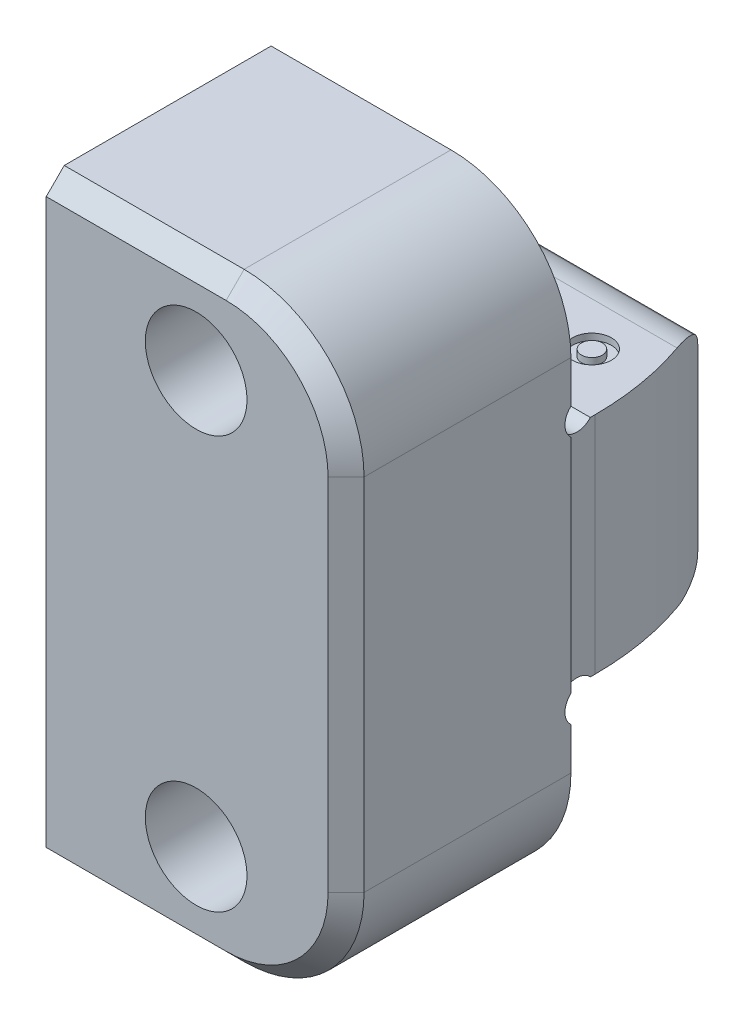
ISO-10303-21;
HEADER;
FILE_DESCRIPTION(('STEP AP214'),'2;1');
FILE_NAME('part.step','',(''),(''),'','','');
FILE_SCHEMA(('AUTOMOTIVE_DESIGN { 1 0 10303 214 1 1 1 1 }'));
ENDSEC;
DATA;
#1=APPLICATION_CONTEXT('core data for automotive mechanical design processes');
#2=APPLICATION_PROTOCOL_DEFINITION('international standard','automotive_design',2000,#1);
#3=PRODUCT_CONTEXT('',#1,'mechanical');
#4=PRODUCT('Part','Part','',(#3));
#5=PRODUCT_RELATED_PRODUCT_CATEGORY('part','',(#4));
#6=PRODUCT_DEFINITION_FORMATION('','',#4);
#7=PRODUCT_DEFINITION_CONTEXT('part definition',#1,'design');
#8=PRODUCT_DEFINITION('design','',#6,#7);
#9=PRODUCT_DEFINITION_SHAPE('','',#8);
#10=(LENGTH_UNIT() NAMED_UNIT(*) SI_UNIT(.MILLI.,.METRE.));
#11=(NAMED_UNIT(*) PLANE_ANGLE_UNIT() SI_UNIT($,.RADIAN.));
#12=(NAMED_UNIT(*) SI_UNIT($,.STERADIAN.) SOLID_ANGLE_UNIT());
#13=UNCERTAINTY_MEASURE_WITH_UNIT(LENGTH_MEASURE(1.E-05),#10,'distance_accuracy_value','');
#14=(GEOMETRIC_REPRESENTATION_CONTEXT(3) GLOBAL_UNCERTAINTY_ASSIGNED_CONTEXT((#13)) GLOBAL_UNIT_ASSIGNED_CONTEXT((#10,
#11,#12)) REPRESENTATION_CONTEXT('',''));
#15=CARTESIAN_POINT('',(0.,0.,0.));
#16=DIRECTION('',(0.,0.,1.));
#17=DIRECTION('',(1.,0.,0.));
#18=AXIS2_PLACEMENT_3D('',#15,#16,#17);
#19=CARTESIAN_POINT('',(6.35,4.75996,0.));
#20=DIRECTION('',(0.,0.,1.));
#21=DIRECTION('',(1.,0.,0.));
#22=AXIS2_PLACEMENT_3D('',#19,#20,#21);
#23=PLANE('',#22);
#24=DIRECTION('',(0.,1.,0.));
#25=VECTOR('',#24,1.);
#26=CARTESIAN_POINT('',(-6.35,-4.75996,0.));
#27=LINE('',#26,#25);
#28=CARTESIAN_POINT('',(-6.35,-12.7,0.));
#29=VERTEX_POINT('',#28);
#30=CARTESIAN_POINT('',(-6.35,-5.83592126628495,0.));
#31=VERTEX_POINT('',#30);
#32=EDGE_CURVE('E210',#29,#31,#27,.T.);
#33=ORIENTED_EDGE('',*,*,#32,.T.);
#34=DIRECTION('',(1.,0.,0.));
#35=VECTOR('',#34,1.);
#36=CARTESIAN_POINT('',(-6.35,-5.83592126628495,0.));
#37=LINE('',#36,#35);
#38=CARTESIAN_POINT('',(-1.30295683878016,-5.83592126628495,0.));
#39=VERTEX_POINT('',#38);
#40=EDGE_CURVE('E192',#31,#39,#37,.T.);
#41=ORIENTED_EDGE('',*,*,#40,.T.);
#42=CARTESIAN_POINT('',(0.,-8.73125,0.));
#43=DIRECTION('',(0.,0.,-1.));
#44=DIRECTION('',(-1.,0.,0.));
#45=AXIS2_PLACEMENT_3D('',#42,#43,#44);
#46=CIRCLE('',#45,3.175);
#47=CARTESIAN_POINT('',(1.30295683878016,-5.83592126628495,0.));
#48=VERTEX_POINT('',#47);
#49=EDGE_CURVE('E525',#48,#39,#46,.T.);
#50=ORIENTED_EDGE('',*,*,#49,.F.);
#51=CARTESIAN_POINT('',(6.35,-5.83592126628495,0.));
#52=VERTEX_POINT('',#51);
#53=EDGE_CURVE('E203',#48,#52,#37,.T.);
#54=ORIENTED_EDGE('',*,*,#53,.T.);
#55=DIRECTION('',(0.,1.,0.));
#56=VECTOR('',#55,1.);
#57=CARTESIAN_POINT('',(6.35,4.75996,0.));
#58=LINE('',#57,#56);
#59=CARTESIAN_POINT('',(6.35,-7.62,0.));
#60=VERTEX_POINT('',#59);
#61=EDGE_CURVE('E236',#60,#52,#58,.T.);
#62=ORIENTED_EDGE('',*,*,#61,.F.);
#63=CARTESIAN_POINT('',(1.27,-7.62,0.));
#64=DIRECTION('',(0.,0.,1.));
#65=DIRECTION('',(0.,-1.,0.));
#66=AXIS2_PLACEMENT_3D('',#63,#64,#65);
#67=CIRCLE('',#66,5.08);
#68=CARTESIAN_POINT('',(1.27,-12.7,0.));
#69=VERTEX_POINT('',#68);
#70=EDGE_CURVE('E244',#60,#69,#67,.F.);
#71=ORIENTED_EDGE('',*,*,#70,.T.);
#72=DIRECTION('',(-1.,0.,0.));
#73=VECTOR('',#72,1.);
#74=CARTESIAN_POINT('',(6.35,-12.7,0.));
#75=LINE('',#74,#73);
#76=EDGE_CURVE('E217',#69,#29,#75,.T.);
#77=ORIENTED_EDGE('',*,*,#76,.T.);
#78=EDGE_LOOP('',(#33,#41,#50,#54,#62,#71,#77));
#79=FACE_BOUND('',#78,.T.);
#80=ADVANCED_FACE('F32',(#79),#23,.F.);
#81=CARTESIAN_POINT('',(6.35,-4.69999873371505,0.));
#82=VERTEX_POINT('',#81);
#83=CARTESIAN_POINT('',(6.35,4.69999873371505,0.));
#84=VERTEX_POINT('',#83);
#85=EDGE_CURVE('E465',#82,#84,#58,.T.);
#86=ORIENTED_EDGE('',*,*,#85,.F.);
#87=DIRECTION('',(1.,0.,0.));
#88=VECTOR('',#87,1.);
#89=CARTESIAN_POINT('',(-6.35,-4.69999873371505,0.));
#90=LINE('',#89,#88);
#91=CARTESIAN_POINT('',(6.096,-4.69999873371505,0.));
#92=VERTEX_POINT('',#91);
#93=EDGE_CURVE('E377',#82,#92,#90,.F.);
#94=ORIENTED_EDGE('',*,*,#93,.T.);
#95=DIRECTION('',(0.,1.,0.));
#96=VECTOR('',#95,1.);
#97=CARTESIAN_POINT('',(6.096,-12.7,0.));
#98=LINE('',#97,#96);
#99=CARTESIAN_POINT('',(6.096,4.69999873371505,0.));
#100=VERTEX_POINT('',#99);
#101=EDGE_CURVE('E54',#92,#100,#98,.T.);
#102=ORIENTED_EDGE('',*,*,#101,.T.);
#103=DIRECTION('',(1.,0.,0.));
#104=VECTOR('',#103,1.);
#105=CARTESIAN_POINT('',(-6.35,4.69999873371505,0.));
#106=LINE('',#105,#104);
#107=EDGE_CURVE('E466',#100,#84,#106,.T.);
#108=ORIENTED_EDGE('',*,*,#107,.T.);
#109=EDGE_LOOP('',(#86,#94,#102,#108));
#110=FACE_BOUND('',#109,.T.);
#111=ADVANCED_FACE('F405',(#110),#23,.F.);
#112=CARTESIAN_POINT('',(6.35,-4.75996,0.));
#113=DIRECTION('',(0.,1.,0.));
#114=DIRECTION('',(0.,0.,1.));
#115=AXIS2_PLACEMENT_3D('',#112,#113,#114);
#116=PLANE('',#115);
#117=CARTESIAN_POINT('',(3.6195,-4.75996,-3.6195));
#118=DIRECTION('',(0.,1.,0.));
#119=DIRECTION('',(0.,0.,1.));
#120=AXIS2_PLACEMENT_3D('',#117,#118,#119);
#121=CIRCLE('',#120,0.8255);
#122=CARTESIAN_POINT('',(3.6195,-4.75996,-2.794));
#123=VERTEX_POINT('',#122);
#124=EDGE_CURVE('E1138',#123,#123,#121,.T.);
#125=ORIENTED_EDGE('',*,*,#124,.T.);
#126=EDGE_LOOP('',(#125));
#127=FACE_BOUND('',#126,.T.);
#128=CARTESIAN_POINT('',(1.0795,-4.75996,-3.6195));
#129=DIRECTION('',(0.,1.,0.));
#130=DIRECTION('',(0.,0.,1.));
#131=AXIS2_PLACEMENT_3D('',#128,#129,#130);
#132=CIRCLE('',#131,0.8255);
#133=CARTESIAN_POINT('',(1.0795,-4.75996,-2.794));
#134=VERTEX_POINT('',#133);
#135=EDGE_CURVE('E1150',#134,#134,#132,.T.);
#136=ORIENTED_EDGE('',*,*,#135,.T.);
#137=EDGE_LOOP('',(#136));
#138=FACE_BOUND('',#137,.T.);
#139=CARTESIAN_POINT('',(-1.4605,-4.75996,-3.6195));
#140=DIRECTION('',(0.,1.,0.));
#141=DIRECTION('',(0.,0.,1.));
#142=AXIS2_PLACEMENT_3D('',#139,#140,#141);
#143=CIRCLE('',#142,0.8255);
#144=CARTESIAN_POINT('',(-1.4605,-4.75996,-2.794));
#145=VERTEX_POINT('',#144);
#146=EDGE_CURVE('E1162',#145,#145,#143,.T.);
#147=ORIENTED_EDGE('',*,*,#146,.T.);
#148=EDGE_LOOP('',(#147));
#149=FACE_BOUND('',#148,.T.);
#150=CARTESIAN_POINT('',(-4.0005,-4.75996,-3.6195));
#151=DIRECTION('',(0.,1.,0.));
#152=DIRECTION('',(0.,0.,1.));
#153=AXIS2_PLACEMENT_3D('',#150,#151,#152);
#154=CIRCLE('',#153,0.8255);
#155=CARTESIAN_POINT('',(-4.0005,-4.75996,-2.794));
#156=VERTEX_POINT('',#155);
#157=EDGE_CURVE('E1174',#156,#156,#154,.T.);
#158=ORIENTED_EDGE('',*,*,#157,.T.);
#159=EDGE_LOOP('',(#158));
#160=FACE_BOUND('',#159,.T.);
#161=DIRECTION('',(0.,0.,1.));
#162=VECTOR('',#161,1.);
#163=CARTESIAN_POINT('',(6.096,-4.75996,0.));
#164=LINE('',#163,#162);
#165=CARTESIAN_POINT('',(6.096,-4.75996,-1.27));
#166=VERTEX_POINT('',#165);
#167=CARTESIAN_POINT('',(6.096,-4.75996,-1.07596126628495));
#168=VERTEX_POINT('',#167);
#169=EDGE_CURVE('E553',#166,#168,#164,.T.);
#170=ORIENTED_EDGE('',*,*,#169,.T.);
#171=DIRECTION('',(1.,0.,0.));
#172=VECTOR('',#171,1.);
#173=CARTESIAN_POINT('',(-6.35,-4.75996,-1.07596126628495));
#174=LINE('',#173,#172);
#175=CARTESIAN_POINT('',(-6.35,-4.75996,-1.07596126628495));
#176=VERTEX_POINT('',#175);
#177=EDGE_CURVE('E47',#168,#176,#174,.F.);
#178=ORIENTED_EDGE('',*,*,#177,.T.);
#179=DIRECTION('',(0.,0.,-1.));
#180=VECTOR('',#179,1.);
#181=CARTESIAN_POINT('',(-6.35,-4.75996,0.));
#182=LINE('',#181,#180);
#183=CARTESIAN_POINT('',(-6.35,-4.75996,-5.461));
#184=VERTEX_POINT('',#183);
#185=EDGE_CURVE('E212',#176,#184,#182,.T.);
#186=ORIENTED_EDGE('',*,*,#185,.T.);
#187=DIRECTION('',(1.,0.,0.));
#188=VECTOR('',#187,1.);
#189=CARTESIAN_POINT('',(-6.35,-4.75996,-5.461));
#190=LINE('',#189,#188);
#191=CARTESIAN_POINT('',(5.3845578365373,-4.75996,-5.461));
#192=VERTEX_POINT('',#191);
#193=EDGE_CURVE('E563',#184,#192,#190,.T.);
#194=ORIENTED_EDGE('',*,*,#193,.T.);
#195=CARTESIAN_POINT('',(-6.604,-4.75996,-1.27));
#196=DIRECTION('',(0.,1.,0.));
#197=DIRECTION('',(0.,0.,1.));
#198=AXIS2_PLACEMENT_3D('',#195,#196,#197);
#199=CIRCLE('',#198,12.7);
#200=EDGE_CURVE('E330',#192,#166,#199,.F.);
#201=ORIENTED_EDGE('',*,*,#200,.T.);
#202=EDGE_LOOP('',(#170,#178,#186,#194,#201));
#203=FACE_BOUND('',#202,.T.);
#204=ADVANCED_FACE('F416',(#127,#138,#149,#160,#203),#116,.F.);
#205=CARTESIAN_POINT('',(6.35,4.75996,-6.985));
#206=DIRECTION('',(0.,0.,1.));
#207=DIRECTION('',(0.,-1.,0.));
#208=AXIS2_PLACEMENT_3D('',#205,#206,#207);
#209=PLANE('',#208);
#210=DIRECTION('',(1.,0.,0.));
#211=VECTOR('',#210,1.);
#212=CARTESIAN_POINT('',(-6.35,3.79378271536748,-6.985));
#213=LINE('',#212,#211);
#214=CARTESIAN_POINT('',(-6.35,3.79378271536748,-6.985));
#215=VERTEX_POINT('',#214);
#216=CARTESIAN_POINT('',(4.73746264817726,3.79378271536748,-6.985));
#217=VERTEX_POINT('',#216);
#218=EDGE_CURVE('E284',#215,#217,#213,.T.);
#219=ORIENTED_EDGE('',*,*,#218,.T.);
#220=DIRECTION('',(0.,1.,0.));
#221=VECTOR('',#220,1.);
#222=CARTESIAN_POINT('',(4.73746264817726,-12.7,-6.985));
#223=LINE('',#222,#221);
#224=CARTESIAN_POINT('',(4.73746264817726,-3.79378271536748,-6.985));
#225=VERTEX_POINT('',#224);
#226=EDGE_CURVE('E599',#225,#217,#223,.T.);
#227=ORIENTED_EDGE('',*,*,#226,.F.);
#228=DIRECTION('',(1.,0.,0.));
#229=VECTOR('',#228,1.);
#230=CARTESIAN_POINT('',(-6.35,-3.79378271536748,-6.985));
#231=LINE('',#230,#229);
#232=CARTESIAN_POINT('',(-6.35,-3.79378271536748,-6.985));
#233=VERTEX_POINT('',#232);
#234=EDGE_CURVE('E568',#233,#225,#231,.T.);
#235=ORIENTED_EDGE('',*,*,#234,.F.);
#236=DIRECTION('',(0.,1.,0.));
#237=VECTOR('',#236,1.);
#238=CARTESIAN_POINT('',(-6.35,4.75996,-6.985));
#239=LINE('',#238,#237);
#240=EDGE_CURVE('E220',#233,#215,#239,.T.);
#241=ORIENTED_EDGE('',*,*,#240,.T.);
#242=EDGE_LOOP('',(#219,#227,#235,#241));
#243=FACE_BOUND('',#242,.T.);
#244=ADVANCED_FACE('F412',(#243),#209,.F.);
#245=CARTESIAN_POINT('',(6.35,12.7,0.));
#246=DIRECTION('',(0.,-1.,0.));
#247=DIRECTION('',(0.,0.,-1.));
#248=AXIS2_PLACEMENT_3D('',#245,#246,#247);
#249=PLANE('',#248);
#250=DIRECTION('',(0.,0.,1.));
#251=VECTOR('',#250,1.);
#252=CARTESIAN_POINT('',(-6.35,12.7,0.));
#253=LINE('',#252,#251);
#254=CARTESIAN_POINT('',(-6.35,12.7,0.));
#255=VERTEX_POINT('',#254);
#256=CARTESIAN_POINT('',(-6.35,12.7,8.76299999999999));
#257=VERTEX_POINT('',#256);
#258=EDGE_CURVE('E476',#255,#257,#253,.T.);
#259=ORIENTED_EDGE('',*,*,#258,.T.);
#260=DIRECTION('',(1.,0.,0.));
#261=VECTOR('',#260,1.);
#262=CARTESIAN_POINT('',(6.35,12.7,8.763));
#263=LINE('',#262,#261);
#264=CARTESIAN_POINT('',(1.27,12.7,8.763));
#265=VERTEX_POINT('',#264);
#266=EDGE_CURVE('E275',#257,#265,#263,.T.);
#267=ORIENTED_EDGE('',*,*,#266,.T.);
#268=DIRECTION('',(0.,0.,1.));
#269=VECTOR('',#268,1.);
#270=CARTESIAN_POINT('',(1.27,12.7,0.));
#271=LINE('',#270,#269);
#272=CARTESIAN_POINT('',(1.27,12.7,0.));
#273=VERTEX_POINT('',#272);
#274=EDGE_CURVE('E249',#265,#273,#271,.F.);
#275=ORIENTED_EDGE('',*,*,#274,.T.);
#276=DIRECTION('',(-1.,0.,0.));
#277=VECTOR('',#276,1.);
#278=CARTESIAN_POINT('',(6.35,12.7,0.));
#279=LINE('',#278,#277);
#280=EDGE_CURVE('E233',#273,#255,#279,.T.);
#281=ORIENTED_EDGE('',*,*,#280,.T.);
#282=EDGE_LOOP('',(#259,#267,#275,#281));
#283=FACE_BOUND('',#282,.T.);
#284=ADVANCED_FACE('F415',(#283),#249,.F.);
#285=CARTESIAN_POINT('',(6.35,12.7,9.525));
#286=DIRECTION('',(0.,0.,-1.));
#287=DIRECTION('',(-1.,0.,0.));
#288=AXIS2_PLACEMENT_3D('',#285,#286,#287);
#289=PLANE('',#288);
#290=DIRECTION('',(0.,-1.,0.));
#291=VECTOR('',#290,1.);
#292=CARTESIAN_POINT('',(-6.35,12.7,9.525));
#293=LINE('',#292,#291);
#294=CARTESIAN_POINT('',(-6.35,11.938,9.525));
#295=VERTEX_POINT('',#294);
#296=CARTESIAN_POINT('',(-6.35,-11.938,9.525));
#297=VERTEX_POINT('',#296);
#298=EDGE_CURVE('E222',#295,#297,#293,.T.);
#299=ORIENTED_EDGE('',*,*,#298,.T.);
#300=DIRECTION('',(1.,0.,0.));
#301=VECTOR('',#300,1.);
#302=CARTESIAN_POINT('',(6.35,-11.938,9.525));
#303=LINE('',#302,#301);
#304=CARTESIAN_POINT('',(1.27,-11.938,9.525));
#305=VERTEX_POINT('',#304);
#306=EDGE_CURVE('E269',#297,#305,#303,.T.);
#307=ORIENTED_EDGE('',*,*,#306,.T.);
#308=CARTESIAN_POINT('',(1.27,-7.62,9.525));
#309=DIRECTION('',(0.,0.,-1.));
#310=DIRECTION('',(-1.,0.,0.));
#311=AXIS2_PLACEMENT_3D('',#308,#309,#310);
#312=CIRCLE('',#311,4.318);
#313=CARTESIAN_POINT('',(5.588,-7.62,9.525));
#314=VERTEX_POINT('',#313);
#315=EDGE_CURVE('E267',#305,#314,#312,.F.);
#316=ORIENTED_EDGE('',*,*,#315,.T.);
#317=DIRECTION('',(0.,1.,0.));
#318=VECTOR('',#317,1.);
#319=CARTESIAN_POINT('',(5.588,7.62,9.525));
#320=LINE('',#319,#318);
#321=CARTESIAN_POINT('',(5.588,7.62,9.525));
#322=VERTEX_POINT('',#321);
#323=EDGE_CURVE('E265',#314,#322,#320,.T.);
#324=ORIENTED_EDGE('',*,*,#323,.T.);
#325=CARTESIAN_POINT('',(1.27,7.62,9.525));
#326=DIRECTION('',(0.,0.,-1.));
#327=DIRECTION('',(-1.,0.,0.));
#328=AXIS2_PLACEMENT_3D('',#325,#326,#327);
#329=CIRCLE('',#328,4.318);
#330=CARTESIAN_POINT('',(1.27,11.938,9.525));
#331=VERTEX_POINT('',#330);
#332=EDGE_CURVE('E261',#322,#331,#329,.F.);
#333=ORIENTED_EDGE('',*,*,#332,.T.);
#334=DIRECTION('',(-1.,0.,0.));
#335=VECTOR('',#334,1.);
#336=CARTESIAN_POINT('',(6.35,11.938,9.525));
#337=LINE('',#336,#335);
#338=EDGE_CURVE('E263',#331,#295,#337,.T.);
#339=ORIENTED_EDGE('',*,*,#338,.T.);
#340=EDGE_LOOP('',(#299,#307,#316,#324,#333,#339));
#341=FACE_BOUND('',#340,.T.);
#342=CARTESIAN_POINT('',(0.,8.73125,9.525));
#343=DIRECTION('',(0.,0.,-1.));
#344=DIRECTION('',(-1.,0.,0.));
#345=AXIS2_PLACEMENT_3D('',#342,#343,#344);
#346=CIRCLE('',#345,2.15265);
#347=CARTESIAN_POINT('',(-2.15265,8.73125,9.525));
#348=VERTEX_POINT('',#347);
#349=EDGE_CURVE('E522',#348,#348,#346,.T.);
#350=ORIENTED_EDGE('',*,*,#349,.T.);
#351=EDGE_LOOP('',(#350));
#352=FACE_BOUND('',#351,.T.);
#353=CARTESIAN_POINT('',(0.,-8.73125,9.525));
#354=DIRECTION('',(0.,0.,-1.));
#355=DIRECTION('',(-1.,0.,0.));
#356=AXIS2_PLACEMENT_3D('',#353,#354,#355);
#357=CIRCLE('',#356,2.15265);
#358=CARTESIAN_POINT('',(-2.15265,-8.73125,9.525));
#359=VERTEX_POINT('',#358);
#360=EDGE_CURVE('E474',#359,#359,#357,.T.);
#361=ORIENTED_EDGE('',*,*,#360,.T.);
#362=EDGE_LOOP('',(#361));
#363=FACE_BOUND('',#362,.T.);
#364=ADVANCED_FACE('F425',(#341,#352,#363),#289,.F.);
#365=CARTESIAN_POINT('',(6.35,-12.7,0.));
#366=DIRECTION('',(0.,1.,0.));
#367=DIRECTION('',(0.,0.,1.));
#368=AXIS2_PLACEMENT_3D('',#365,#366,#367);
#369=PLANE('',#368);
#370=DIRECTION('',(0.,0.,-1.));
#371=VECTOR('',#370,1.);
#372=CARTESIAN_POINT('',(1.27,-12.7,9.525));
#373=LINE('',#372,#371);
#374=CARTESIAN_POINT('',(1.27,-12.7,8.763));
#375=VERTEX_POINT('',#374);
#376=EDGE_CURVE('E246',#69,#375,#373,.F.);
#377=ORIENTED_EDGE('',*,*,#376,.T.);
#378=DIRECTION('',(-1.,0.,0.));
#379=VECTOR('',#378,1.);
#380=CARTESIAN_POINT('',(6.35,-12.7,8.763));
#381=LINE('',#380,#379);
#382=CARTESIAN_POINT('',(-6.35,-12.7,8.76299999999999));
#383=VERTEX_POINT('',#382);
#384=EDGE_CURVE('E254',#375,#383,#381,.T.);
#385=ORIENTED_EDGE('',*,*,#384,.T.);
#386=DIRECTION('',(0.,0.,-1.));
#387=VECTOR('',#386,1.);
#388=CARTESIAN_POINT('',(-6.35,-12.7,0.));
#389=LINE('',#388,#387);
#390=EDGE_CURVE('E218',#383,#29,#389,.T.);
#391=ORIENTED_EDGE('',*,*,#390,.T.);
#392=ORIENTED_EDGE('',*,*,#76,.F.);
#393=EDGE_LOOP('',(#377,#385,#391,#392));
#394=FACE_BOUND('',#393,.T.);
#395=ADVANCED_FACE('F408',(#394),#369,.F.);
#396=CARTESIAN_POINT('',(6.35,4.75996,0.));
#397=DIRECTION('',(0.,-1.,0.));
#398=DIRECTION('',(0.,0.,-1.));
#399=AXIS2_PLACEMENT_3D('',#396,#397,#398);
#400=PLANE('',#399);
#401=CARTESIAN_POINT('',(3.6195,4.75996,-3.6195));
#402=DIRECTION('',(0.,1.,0.));
#403=DIRECTION('',(0.,0.,1.));
#404=AXIS2_PLACEMENT_3D('',#401,#402,#403);
#405=CIRCLE('',#404,0.8255);
#406=CARTESIAN_POINT('',(3.6195,4.75996,-2.794));
#407=VERTEX_POINT('',#406);
#408=EDGE_CURVE('E1186',#407,#407,#405,.T.);
#409=ORIENTED_EDGE('',*,*,#408,.F.);
#410=EDGE_LOOP('',(#409));
#411=FACE_BOUND('',#410,.T.);
#412=CARTESIAN_POINT('',(1.0795,4.75996,-3.6195));
#413=DIRECTION('',(0.,1.,0.));
#414=DIRECTION('',(0.,0.,1.));
#415=AXIS2_PLACEMENT_3D('',#412,#413,#414);
#416=CIRCLE('',#415,0.8255);
#417=CARTESIAN_POINT('',(1.0795,4.75996,-2.794));
#418=VERTEX_POINT('',#417);
#419=EDGE_CURVE('E1198',#418,#418,#416,.T.);
#420=ORIENTED_EDGE('',*,*,#419,.F.);
#421=EDGE_LOOP('',(#420));
#422=FACE_BOUND('',#421,.T.);
#423=CARTESIAN_POINT('',(-1.4605,4.75996,-3.6195));
#424=DIRECTION('',(0.,1.,0.));
#425=DIRECTION('',(0.,0.,1.));
#426=AXIS2_PLACEMENT_3D('',#423,#424,#425);
#427=CIRCLE('',#426,0.8255);
#428=CARTESIAN_POINT('',(-1.4605,4.75996,-2.794));
#429=VERTEX_POINT('',#428);
#430=EDGE_CURVE('E1210',#429,#429,#427,.T.);
#431=ORIENTED_EDGE('',*,*,#430,.F.);
#432=EDGE_LOOP('',(#431));
#433=FACE_BOUND('',#432,.T.);
#434=CARTESIAN_POINT('',(-4.0005,4.75996,-3.6195));
#435=DIRECTION('',(0.,1.,0.));
#436=DIRECTION('',(0.,0.,1.));
#437=AXIS2_PLACEMENT_3D('',#434,#435,#436);
#438=CIRCLE('',#437,0.8255);
#439=CARTESIAN_POINT('',(-4.0005,4.75996,-2.794));
#440=VERTEX_POINT('',#439);
#441=EDGE_CURVE('E545',#440,#440,#438,.T.);
#442=ORIENTED_EDGE('',*,*,#441,.F.);
#443=EDGE_LOOP('',(#442));
#444=FACE_BOUND('',#443,.T.);
#445=DIRECTION('',(0.,0.,1.));
#446=VECTOR('',#445,1.);
#447=CARTESIAN_POINT('',(-6.35,4.75996,0.));
#448=LINE('',#447,#446);
#449=CARTESIAN_POINT('',(-6.35,4.75996,-5.461));
#450=VERTEX_POINT('',#449);
#451=CARTESIAN_POINT('',(-6.35,4.75996,-1.07596126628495));
#452=VERTEX_POINT('',#451);
#453=EDGE_CURVE('E227',#450,#452,#448,.T.);
#454=ORIENTED_EDGE('',*,*,#453,.T.);
#455=DIRECTION('',(1.,0.,0.));
#456=VECTOR('',#455,1.);
#457=CARTESIAN_POINT('',(-6.35,4.75996,-1.07596126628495));
#458=LINE('',#457,#456);
#459=CARTESIAN_POINT('',(6.096,4.75996,-1.07596126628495));
#460=VERTEX_POINT('',#459);
#461=EDGE_CURVE('E360',#452,#460,#458,.T.);
#462=ORIENTED_EDGE('',*,*,#461,.T.);
#463=DIRECTION('',(0.,0.,1.));
#464=VECTOR('',#463,1.);
#465=CARTESIAN_POINT('',(6.096,4.75996,0.));
#466=LINE('',#465,#464);
#467=CARTESIAN_POINT('',(6.096,4.75996,-1.27));
#468=VERTEX_POINT('',#467);
#469=EDGE_CURVE('E595',#468,#460,#466,.T.);
#470=ORIENTED_EDGE('',*,*,#469,.F.);
#471=CARTESIAN_POINT('',(-6.604,4.75996,-1.27));
#472=DIRECTION('',(0.,-1.,0.));
#473=DIRECTION('',(0.,0.,1.));
#474=AXIS2_PLACEMENT_3D('',#471,#472,#473);
#475=CIRCLE('',#474,12.7);
#476=CARTESIAN_POINT('',(5.3845578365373,4.75996,-5.461));
#477=VERTEX_POINT('',#476);
#478=EDGE_CURVE('E509',#477,#468,#475,.T.);
#479=ORIENTED_EDGE('',*,*,#478,.F.);
#480=DIRECTION('',(1.,0.,0.));
#481=VECTOR('',#480,1.);
#482=CARTESIAN_POINT('',(-6.35,4.75996,-5.461));
#483=LINE('',#482,#481);
#484=EDGE_CURVE('E517',#450,#477,#483,.T.);
#485=ORIENTED_EDGE('',*,*,#484,.F.);
#486=EDGE_LOOP('',(#454,#462,#470,#479,#485));
#487=FACE_BOUND('',#486,.T.);
#488=ADVANCED_FACE('F403',(#411,#422,#433,#444,#487),#400,.F.);
#489=CARTESIAN_POINT('',(6.35,5.83592126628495,0.));
#490=VERTEX_POINT('',#489);
#491=CARTESIAN_POINT('',(6.35,7.62,0.));
#492=VERTEX_POINT('',#491);
#493=EDGE_CURVE('E232',#490,#492,#58,.T.);
#494=ORIENTED_EDGE('',*,*,#493,.F.);
#495=DIRECTION('',(1.,0.,0.));
#496=VECTOR('',#495,1.);
#497=CARTESIAN_POINT('',(-6.35,5.83592126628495,0.));
#498=LINE('',#497,#496);
#499=CARTESIAN_POINT('',(1.30295683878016,5.83592126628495,0.));
#500=VERTEX_POINT('',#499);
#501=EDGE_CURVE('E507',#490,#500,#498,.F.);
#502=ORIENTED_EDGE('',*,*,#501,.T.);
#503=CARTESIAN_POINT('',(0.,8.73125,0.));
#504=DIRECTION('',(0.,0.,-1.));
#505=DIRECTION('',(-1.,0.,0.));
#506=AXIS2_PLACEMENT_3D('',#503,#504,#505);
#507=CIRCLE('',#506,3.175);
#508=CARTESIAN_POINT('',(-1.30295683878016,5.83592126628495,0.));
#509=VERTEX_POINT('',#508);
#510=EDGE_CURVE('E293',#509,#500,#507,.T.);
#511=ORIENTED_EDGE('',*,*,#510,.F.);
#512=CARTESIAN_POINT('',(-6.35,5.83592126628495,0.));
#513=VERTEX_POINT('',#512);
#514=EDGE_CURVE('E359',#509,#513,#498,.F.);
#515=ORIENTED_EDGE('',*,*,#514,.T.);
#516=DIRECTION('',(0.,1.,0.));
#517=VECTOR('',#516,1.);
#518=CARTESIAN_POINT('',(-6.35,4.75996,0.));
#519=LINE('',#518,#517);
#520=EDGE_CURVE('E230',#513,#255,#519,.T.);
#521=ORIENTED_EDGE('',*,*,#520,.T.);
#522=ORIENTED_EDGE('',*,*,#280,.F.);
#523=CARTESIAN_POINT('',(1.27,7.62,0.));
#524=DIRECTION('',(0.,0.,1.));
#525=DIRECTION('',(1.,0.,0.));
#526=AXIS2_PLACEMENT_3D('',#523,#524,#525);
#527=CIRCLE('',#526,5.08);
#528=EDGE_CURVE('E251',#273,#492,#527,.F.);
#529=ORIENTED_EDGE('',*,*,#528,.T.);
#530=EDGE_LOOP('',(#494,#502,#511,#515,#521,#522,#529));
#531=FACE_BOUND('',#530,.T.);
#532=ADVANCED_FACE('F397',(#531),#23,.F.);
#533=CARTESIAN_POINT('',(6.35,0.,0.));
#534=DIRECTION('',(1.,0.,0.));
#535=DIRECTION('',(0.,0.,-1.));
#536=AXIS2_PLACEMENT_3D('',#533,#534,#535);
#537=PLANE('',#536);
#538=CARTESIAN_POINT('',(6.35,-5.26796,-0.508));
#539=DIRECTION('',(1.,0.,0.));
#540=DIRECTION('',(0.,0.,1.));
#541=AXIS2_PLACEMENT_3D('',#538,#539,#540);
#542=CIRCLE('',#541,0.762000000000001);
#543=EDGE_CURVE('E213',#82,#52,#542,.T.);
#544=ORIENTED_EDGE('',*,*,#543,.F.);
#545=ORIENTED_EDGE('',*,*,#85,.T.);
#546=CARTESIAN_POINT('',(6.35,5.26796,-0.508));
#547=DIRECTION('',(1.,0.,0.));
#548=DIRECTION('',(0.,0.,-1.));
#549=AXIS2_PLACEMENT_3D('',#546,#547,#548);
#550=CIRCLE('',#549,0.762000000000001);
#551=EDGE_CURVE('E202',#490,#84,#550,.T.);
#552=ORIENTED_EDGE('',*,*,#551,.F.);
#553=ORIENTED_EDGE('',*,*,#493,.T.);
#554=DIRECTION('',(0.,0.,1.));
#555=VECTOR('',#554,1.);
#556=CARTESIAN_POINT('',(6.35,7.62,9.525));
#557=LINE('',#556,#555);
#558=CARTESIAN_POINT('',(6.35,7.62,8.763));
#559=VERTEX_POINT('',#558);
#560=EDGE_CURVE('E238',#492,#559,#557,.T.);
#561=ORIENTED_EDGE('',*,*,#560,.T.);
#562=DIRECTION('',(0.,-1.,0.));
#563=VECTOR('',#562,1.);
#564=CARTESIAN_POINT('',(6.35,-7.61999999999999,8.763));
#565=LINE('',#564,#563);
#566=CARTESIAN_POINT('',(6.35,-7.62,8.763));
#567=VERTEX_POINT('',#566);
#568=EDGE_CURVE('E273',#559,#567,#565,.T.);
#569=ORIENTED_EDGE('',*,*,#568,.T.);
#570=DIRECTION('',(0.,0.,-1.));
#571=VECTOR('',#570,1.);
#572=CARTESIAN_POINT('',(6.35,-7.62,0.));
#573=LINE('',#572,#571);
#574=EDGE_CURVE('E241',#567,#60,#573,.T.);
#575=ORIENTED_EDGE('',*,*,#574,.T.);
#576=ORIENTED_EDGE('',*,*,#61,.T.);
#577=EDGE_LOOP('',(#544,#545,#552,#553,#561,#569,#575,#576));
#578=FACE_BOUND('',#577,.T.);
#579=ADVANCED_FACE('F394',(#578),#537,.T.);
#580=CARTESIAN_POINT('',(-6.35,0.,0.));
#581=DIRECTION('',(1.,0.,0.));
#582=DIRECTION('',(0.,0.,-1.));
#583=AXIS2_PLACEMENT_3D('',#580,#581,#582);
#584=PLANE('',#583);
#585=ORIENTED_EDGE('',*,*,#185,.F.);
#586=CARTESIAN_POINT('',(-6.35,-5.26796,-0.508));
#587=DIRECTION('',(1.,0.,0.));
#588=DIRECTION('',(0.,0.,1.));
#589=AXIS2_PLACEMENT_3D('',#586,#587,#588);
#590=CIRCLE('',#589,0.762000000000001);
#591=EDGE_CURVE('E195',#176,#31,#590,.T.);
#592=ORIENTED_EDGE('',*,*,#591,.T.);
#593=ORIENTED_EDGE('',*,*,#32,.F.);
#594=ORIENTED_EDGE('',*,*,#390,.F.);
#595=DIRECTION('',(0.,-0.707106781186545,-0.70710678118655));
#596=VECTOR('',#595,1.);
#597=CARTESIAN_POINT('',(-6.35,-12.7,8.763));
#598=LINE('',#597,#596);
#599=EDGE_CURVE('E259',#383,#297,#598,.F.);
#600=ORIENTED_EDGE('',*,*,#599,.T.);
#601=ORIENTED_EDGE('',*,*,#298,.F.);
#602=DIRECTION('',(0.,-0.707106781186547,0.707106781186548));
#603=VECTOR('',#602,1.);
#604=CARTESIAN_POINT('',(-6.35,11.938,9.525));
#605=LINE('',#604,#603);
#606=EDGE_CURVE('E257',#295,#257,#605,.F.);
#607=ORIENTED_EDGE('',*,*,#606,.T.);
#608=ORIENTED_EDGE('',*,*,#258,.F.);
#609=ORIENTED_EDGE('',*,*,#520,.F.);
#610=CARTESIAN_POINT('',(-6.35,5.26796,-0.508));
#611=DIRECTION('',(1.,0.,0.));
#612=DIRECTION('',(0.,0.,-1.));
#613=AXIS2_PLACEMENT_3D('',#610,#611,#612);
#614=CIRCLE('',#613,0.762000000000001);
#615=EDGE_CURVE('E591',#513,#452,#614,.T.);
#616=ORIENTED_EDGE('',*,*,#615,.T.);
#617=ORIENTED_EDGE('',*,*,#453,.F.);
#618=CARTESIAN_POINT('',(-6.35,2.47396,-5.461));
#619=DIRECTION('',(-1.,0.,0.));
#620=DIRECTION('',(0.,0.,1.));
#621=AXIS2_PLACEMENT_3D('',#618,#619,#620);
#622=CIRCLE('',#621,2.286);
#623=CARTESIAN_POINT('',(-6.35,4.45369407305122,-6.604));
#624=VERTEX_POINT('',#623);
#625=EDGE_CURVE('E567',#450,#624,#622,.T.);
#626=ORIENTED_EDGE('',*,*,#625,.T.);
#627=CARTESIAN_POINT('',(-6.35,3.79378271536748,-6.223));
#628=DIRECTION('',(-1.,0.,0.));
#629=DIRECTION('',(0.,0.,1.));
#630=AXIS2_PLACEMENT_3D('',#627,#628,#629);
#631=CIRCLE('',#630,0.761999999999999);
#632=EDGE_CURVE('E574',#624,#215,#631,.T.);
#633=ORIENTED_EDGE('',*,*,#632,.T.);
#634=ORIENTED_EDGE('',*,*,#240,.F.);
#635=CARTESIAN_POINT('',(-6.35,-3.79378271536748,-6.223));
#636=DIRECTION('',(-1.,0.,0.));
#637=DIRECTION('',(0.,0.,-1.));
#638=AXIS2_PLACEMENT_3D('',#635,#636,#637);
#639=CIRCLE('',#638,0.761999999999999);
#640=CARTESIAN_POINT('',(-6.35,-4.45369407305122,-6.604));
#641=VERTEX_POINT('',#640);
#642=EDGE_CURVE('E557',#233,#641,#639,.T.);
#643=ORIENTED_EDGE('',*,*,#642,.T.);
#644=CARTESIAN_POINT('',(-6.35,-2.47396,-5.461));
#645=DIRECTION('',(-1.,0.,0.));
#646=DIRECTION('',(0.,0.,-1.));
#647=AXIS2_PLACEMENT_3D('',#644,#645,#646);
#648=CIRCLE('',#647,2.286);
#649=EDGE_CURVE('E556',#641,#184,#648,.T.);
#650=ORIENTED_EDGE('',*,*,#649,.T.);
#651=EDGE_LOOP('',(#585,#592,#593,#594,#600,#601,#607,#608,#609,#616,#617,#626,#633,#634,#643,#650));
#652=FACE_BOUND('',#651,.T.);
#653=ADVANCED_FACE('F208',(#652),#584,.F.);
#654=CARTESIAN_POINT('',(0.,-8.73125,0.));
#655=DIRECTION('',(0.,0.,-1.));
#656=DIRECTION('',(-1.,0.,0.));
#657=AXIS2_PLACEMENT_3D('',#654,#655,#656);
#658=CYLINDRICAL_SURFACE('',#657,2.15265);
#659=ORIENTED_EDGE('',*,*,#360,.F.);
#660=EDGE_LOOP('',(#659));
#661=FACE_BOUND('',#660,.T.);
#662=CARTESIAN_POINT('',(0.,-8.73125,4.2672));
#663=DIRECTION('',(0.,0.,-1.));
#664=DIRECTION('',(-1.,0.,0.));
#665=AXIS2_PLACEMENT_3D('',#662,#663,#664);
#666=CIRCLE('',#665,2.15265);
#667=CARTESIAN_POINT('',(-2.15265,-8.73125,4.2672));
#668=VERTEX_POINT('',#667);
#669=EDGE_CURVE('E529',#668,#668,#666,.T.);
#670=ORIENTED_EDGE('',*,*,#669,.T.);
#671=EDGE_LOOP('',(#670));
#672=FACE_BOUND('',#671,.T.);
#673=ADVANCED_FACE('F389',(#661,#672),#658,.F.);
#674=CARTESIAN_POINT('',(2.15265,-8.73125,4.2672));
#675=DIRECTION('',(0.,0.,1.));
#676=DIRECTION('',(1.,0.,0.));
#677=AXIS2_PLACEMENT_3D('',#674,#675,#676);
#678=PLANE('',#677);
#679=ORIENTED_EDGE('',*,*,#669,.F.);
#680=EDGE_LOOP('',(#679));
#681=FACE_BOUND('',#680,.T.);
#682=CARTESIAN_POINT('',(0.,-8.73125,4.2672));
#683=DIRECTION('',(0.,0.,-1.));
#684=DIRECTION('',(-1.,0.,0.));
#685=AXIS2_PLACEMENT_3D('',#682,#683,#684);
#686=CIRCLE('',#685,3.175);
#687=CARTESIAN_POINT('',(-3.175,-8.73125,4.2672));
#688=VERTEX_POINT('',#687);
#689=EDGE_CURVE('E527',#688,#688,#686,.T.);
#690=ORIENTED_EDGE('',*,*,#689,.T.);
#691=EDGE_LOOP('',(#690));
#692=FACE_BOUND('',#691,.T.);
#693=ADVANCED_FACE('F385',(#681,#692),#678,.F.);
#694=CARTESIAN_POINT('',(0.,-8.73125,0.));
#695=DIRECTION('',(0.,0.,-1.));
#696=DIRECTION('',(-1.,0.,0.));
#697=AXIS2_PLACEMENT_3D('',#694,#695,#696);
#698=CYLINDRICAL_SURFACE('',#697,3.175);
#699=ORIENTED_EDGE('',*,*,#689,.F.);
#700=EDGE_LOOP('',(#699));
#701=FACE_BOUND('',#700,.T.);
#702=ORIENTED_EDGE('',*,*,#49,.T.);
#703=CARTESIAN_POINT('',(0.,-5.55625,0.197360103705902));
#704=CARTESIAN_POINT('',(0.0643218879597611,-5.55625008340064,0.197360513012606));
#705=CARTESIAN_POINT('',(0.128645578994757,-5.55820570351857,0.196570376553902));
#706=CARTESIAN_POINT('',(0.257025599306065,-5.56601710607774,0.193301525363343));
#707=CARTESIAN_POINT('',(0.321081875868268,-5.57187362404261,0.19082249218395));
#708=CARTESIAN_POINT('',(0.448537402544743,-5.58743780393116,0.183846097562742));
#709=CARTESIAN_POINT('',(0.51193737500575,-5.59714063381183,0.179351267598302));
#710=CARTESIAN_POINT('',(0.63778523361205,-5.62031029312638,0.167767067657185));
#711=CARTESIAN_POINT('',(0.700233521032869,-5.63377548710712,0.160678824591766));
#712=CARTESIAN_POINT('',(0.82973999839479,-5.66579351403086,0.142191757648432));
#713=CARTESIAN_POINT('',(0.896659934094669,-5.68471243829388,0.130442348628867));
#714=CARTESIAN_POINT('',(1.0280587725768,-5.72651018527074,0.101123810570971));
#715=CARTESIAN_POINT('',(1.09253639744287,-5.74939104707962,0.0835516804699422));
#716=CARTESIAN_POINT('',(1.20850246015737,-5.79467910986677,0.043353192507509));
#717=CARTESIAN_POINT('',(1.26052231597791,-5.81667785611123,0.021822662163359));
#718=CARTESIAN_POINT('',(1.35998643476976,-5.86175487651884,-0.0292391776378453));
#719=CARTESIAN_POINT('',(1.40744544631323,-5.88482928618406,-0.0587434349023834));
#720=CARTESIAN_POINT('',(1.47493852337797,-5.91950488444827,-0.112232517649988));
#721=CARTESIAN_POINT('',(1.4976084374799,-5.93153896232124,-0.132597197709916));
#722=CARTESIAN_POINT('',(1.53999342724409,-5.95462936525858,-0.176716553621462));
#723=CARTESIAN_POINT('',(1.55971113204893,-5.96568655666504,-0.200468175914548));
#724=CARTESIAN_POINT('',(1.59224554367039,-5.98431131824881,-0.247217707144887));
#725=CARTESIAN_POINT('',(1.60566466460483,-5.99215337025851,-0.269682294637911));
#726=CARTESIAN_POINT('',(1.62906718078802,-6.00600678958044,-0.316864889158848));
#727=CARTESIAN_POINT('',(1.63905473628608,-6.01202037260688,-0.341580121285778));
#728=CARTESIAN_POINT('',(1.6537328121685,-6.02092607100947,-0.388932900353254));
#729=CARTESIAN_POINT('',(1.65899103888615,-6.02414988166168,-0.411330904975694));
#730=CARTESIAN_POINT('',(1.66620574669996,-6.02858428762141,-0.456849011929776));
#731=CARTESIAN_POINT('',(1.66816383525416,-6.02979586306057,-0.479968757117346));
#732=CARTESIAN_POINT('',(1.66864491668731,-6.03009297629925,-0.526285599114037));
#733=CARTESIAN_POINT('',(1.66716378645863,-6.02917596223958,-0.549482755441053));
#734=CARTESIAN_POINT('',(1.66086181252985,-6.02529800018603,-0.595241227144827));
#735=CARTESIAN_POINT('',(1.65603991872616,-6.02233640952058,-0.617802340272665));
#736=CARTESIAN_POINT('',(1.6434061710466,-6.01465388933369,-0.661568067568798));
#737=CARTESIAN_POINT('',(1.63561503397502,-6.00994515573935,-0.682780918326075));
#738=CARTESIAN_POINT('',(1.6174500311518,-5.99910935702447,-0.723668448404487));
#739=CARTESIAN_POINT('',(1.60707517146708,-5.99298174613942,-0.743342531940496));
#740=CARTESIAN_POINT('',(1.57811190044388,-5.97614687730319,-0.79092393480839));
#741=CARTESIAN_POINT('',(1.55807756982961,-5.96472880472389,-0.817700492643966));
#742=CARTESIAN_POINT('',(1.5142776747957,-5.94051168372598,-0.867281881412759));
#743=CARTESIAN_POINT('',(1.4905026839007,-5.92770917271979,-0.890076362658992));
#744=CARTESIAN_POINT('',(1.42579165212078,-5.89404806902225,-0.944095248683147));
#745=CARTESIAN_POINT('',(1.38284394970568,-5.87278700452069,-0.972638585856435));
#746=CARTESIAN_POINT('',(1.29274130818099,-5.83091593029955,-1.02257488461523));
#747=CARTESIAN_POINT('',(1.24557721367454,-5.81030747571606,-1.04395178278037));
#748=CARTESIAN_POINT('',(1.15301204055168,-5.77262683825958,-1.07945246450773));
#749=CARTESIAN_POINT('',(1.10785499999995,-5.75540402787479,-1.09406593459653));
#750=CARTESIAN_POINT('',(1.01588782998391,-5.72276506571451,-1.1197414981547));
#751=CARTESIAN_POINT('',(0.969076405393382,-5.70735037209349,-1.13080073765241));
#752=CARTESIAN_POINT('',(0.874175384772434,-5.67856153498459,-1.15014580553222));
#753=CARTESIAN_POINT('',(0.826083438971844,-5.66519149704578,-1.15842609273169));
#754=CARTESIAN_POINT('',(0.729007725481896,-5.64067050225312,-1.1727793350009));
#755=CARTESIAN_POINT('',(0.680023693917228,-5.62952021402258,-1.17885162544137));
#756=CARTESIAN_POINT('',(0.553108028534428,-5.60379720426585,-1.19223447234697));
#757=CARTESIAN_POINT('',(0.474689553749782,-5.59093032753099,-1.19825721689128));
#758=CARTESIAN_POINT('',(0.316911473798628,-5.57110398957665,-1.20718758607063));
#759=CARTESIAN_POINT('',(0.23755136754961,-5.56414783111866,-1.2100934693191));
#760=CARTESIAN_POINT('',(0.0784167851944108,-5.556218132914,-1.21338616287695));
#761=CARTESIAN_POINT('',(-0.00135797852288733,-5.55524952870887,-1.21377089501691));
#762=CARTESIAN_POINT('',(-0.160702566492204,-5.55931880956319,-1.21210218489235));
#763=CARTESIAN_POINT('',(-0.240272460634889,-5.56435426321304,-1.2100497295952));
#764=CARTESIAN_POINT('',(-0.380544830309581,-5.57853998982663,-1.20386430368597));
#765=CARTESIAN_POINT('',(-0.441397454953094,-5.58648472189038,-1.20031501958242));
#766=CARTESIAN_POINT('',(-0.562378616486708,-5.60585311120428,-1.19107279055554));
#767=CARTESIAN_POINT('',(-0.622507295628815,-5.61727607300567,-1.18538027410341));
#768=CARTESIAN_POINT('',(-0.741467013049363,-5.64344400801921,-1.17123184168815));
#769=CARTESIAN_POINT('',(-0.800302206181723,-5.65817581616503,-1.16278681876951));
#770=CARTESIAN_POINT('',(-0.916414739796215,-5.69078323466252,-1.14222190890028));
#771=CARTESIAN_POINT('',(-0.973693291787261,-5.70865631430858,-1.13010497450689));
#772=CARTESIAN_POINT('',(-1.07927421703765,-5.74486078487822,-1.10269413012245));
#773=CARTESIAN_POINT('',(-1.12782659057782,-5.7628774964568,-1.08795889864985));
#774=CARTESIAN_POINT('',(-1.22261709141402,-5.8006467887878,-1.05347676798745));
#775=CARTESIAN_POINT('',(-1.26884967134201,-5.82040324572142,-1.03371848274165));
#776=CARTESIAN_POINT('',(-1.35834189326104,-5.86106182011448,-0.987419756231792));
#777=CARTESIAN_POINT('',(-1.40154730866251,-5.88197657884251,-0.960783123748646));
#778=CARTESIAN_POINT('',(-1.48193614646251,-5.92296003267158,-0.899120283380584));
#779=CARTESIAN_POINT('',(-1.51915289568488,-5.94303291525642,-0.864143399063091));
#780=CARTESIAN_POINT('',(-1.56779151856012,-5.97026953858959,-0.804448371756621));
#781=CARTESIAN_POINT('',(-1.58281573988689,-5.97887533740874,-0.783325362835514));
#782=CARTESIAN_POINT('',(-1.60983050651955,-5.99458923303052,-0.738680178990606));
#783=CARTESIAN_POINT('',(-1.6218219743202,-6.00169778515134,-0.715158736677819));
#784=CARTESIAN_POINT('',(-1.64216235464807,-6.01388507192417,-0.66577120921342));
#785=CARTESIAN_POINT('',(-1.65047321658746,-6.01894255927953,-0.639883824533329));
#786=CARTESIAN_POINT('',(-1.66259871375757,-6.02635757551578,-0.586704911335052));
#787=CARTESIAN_POINT('',(-1.66641861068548,-6.02871826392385,-0.559415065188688));
#788=CARTESIAN_POINT('',(-1.66904259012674,-6.03033849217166,-0.507986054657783));
#789=CARTESIAN_POINT('',(-1.66842085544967,-6.02995305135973,-0.483885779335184));
#790=CARTESIAN_POINT('',(-1.66354209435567,-6.02694588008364,-0.436202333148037));
#791=CARTESIAN_POINT('',(-1.65928499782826,-6.02432410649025,-0.412619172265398));
#792=CARTESIAN_POINT('',(-1.64772291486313,-6.01727201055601,-0.367761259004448));
#793=CARTESIAN_POINT('',(-1.64057569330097,-6.01293552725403,-0.346430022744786));
#794=CARTESIAN_POINT('',(-1.62364922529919,-6.00279151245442,-0.305225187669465));
#795=CARTESIAN_POINT('',(-1.61386913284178,-5.99698350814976,-0.285352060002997));
#796=CARTESIAN_POINT('',(-1.58674085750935,-5.9811175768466,-0.237913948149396));
#797=CARTESIAN_POINT('',(-1.56803325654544,-5.97037222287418,-0.211355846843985));
#798=CARTESIAN_POINT('',(-1.52692359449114,-5.94742380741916,-0.161997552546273));
#799=CARTESIAN_POINT('',(-1.50451268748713,-5.93521727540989,-0.139206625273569));
#800=CARTESIAN_POINT('',(-1.44383072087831,-5.90322899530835,-0.0854727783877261));
#801=CARTESIAN_POINT('',(-1.40364048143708,-5.88298971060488,-0.0569877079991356));
#802=CARTESIAN_POINT('',(-1.31909816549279,-5.84285670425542,-0.00682999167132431));
#803=CARTESIAN_POINT('',(-1.2747365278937,-5.82296390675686,0.014826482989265));
#804=CARTESIAN_POINT('',(-1.18784410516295,-5.78648386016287,0.0508953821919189));
#805=CARTESIAN_POINT('',(-1.14557388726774,-5.76976498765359,0.0658156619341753));
#806=CARTESIAN_POINT('',(-1.05939644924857,-5.7378541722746,0.0922272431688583));
#807=CARTESIAN_POINT('',(-1.01548792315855,-5.72266348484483,0.103715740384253));
#808=CARTESIAN_POINT('',(-0.926424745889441,-5.69405491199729,0.123976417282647));
#809=CARTESIAN_POINT('',(-0.881268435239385,-5.68063953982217,0.132744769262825));
#810=CARTESIAN_POINT('',(-0.790054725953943,-5.65575411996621,0.14810445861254));
#811=CARTESIAN_POINT('',(-0.743997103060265,-5.64428456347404,0.154695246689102));
#812=CARTESIAN_POINT('',(-0.640725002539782,-5.62102576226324,0.167427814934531));
#813=CARTESIAN_POINT('',(-0.583340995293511,-5.60974982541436,0.173131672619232));
#814=CARTESIAN_POINT('',(-0.467873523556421,-5.59036659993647,0.182516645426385));
#815=CARTESIAN_POINT('',(-0.409789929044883,-5.58225990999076,0.186197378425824));
#816=CARTESIAN_POINT('',(-0.2931949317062,-5.56927247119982,0.191932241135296));
#817=CARTESIAN_POINT('',(-0.234683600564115,-5.56439119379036,0.193986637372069));
#818=CARTESIAN_POINT('',(-0.117448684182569,-5.55787987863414,0.196700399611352));
#819=CARTESIAN_POINT('',(-0.0587250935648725,-5.55624992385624,0.197359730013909));
#820=CARTESIAN_POINT('',(0.,-5.55625,0.197360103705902));
#821=B_SPLINE_CURVE_WITH_KNOTS('',3,(#703,#704,#705,#706,#707,#708,#709,#710,#711,#712,#713,
#714,#715,#716,#717,#718,#719,#720,#721,#722,#723,#724,#725,#726,#727,#728,#729,#730,#731,#732,
#733,#734,#735,#736,#737,#738,#739,#740,#741,#742,#743,#744,#745,#746,#747,#748,#749,#750,#751,
#752,#753,#754,#755,#756,#757,#758,#759,#760,#761,#762,#763,#764,#765,#766,#767,#768,#769,#770,
#771,#772,#773,#774,#775,#776,#777,#778,#779,#780,#781,#782,#783,#784,#785,#786,#787,#788,#789,
#790,#791,#792,#793,#794,#795,#796,#797,#798,#799,#800,#801,#802,#803,#804,#805,#806,#807,#808,
#809,#810,#811,#812,#813,#814,#815,#816,#817,#818,#819,#820),.UNSPECIFIED.,.T.,.F.,(4,2,2,2,2,2,
2,2,2,2,2,2,2,2,2,2,2,2,2,2,2,2,2,2,2,2,2,2,2,2,2,2,2,2,2,2,2,2,2,2,2,2,2,2,2,2,2,2,2,2,2,2,2,2,
2,2,2,2,4),(0.,0.192933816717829,0.385904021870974,0.57863256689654,0.771277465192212,
0.982553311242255,1.19393821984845,1.37480761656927,1.55507092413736,1.65311723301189,
1.75107569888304,1.83271906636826,1.91426310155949,1.98365068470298,2.05300446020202,
2.12244142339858,2.19190022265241,2.26088301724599,2.32989238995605,2.43530066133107,
2.54097894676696,2.70737377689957,2.87413912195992,3.02539347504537,3.17676898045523,
3.32844455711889,3.48016575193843,3.71891938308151,3.95780633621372,4.19689017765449,
4.43587723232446,4.62016666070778,4.8044192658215,4.98795136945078,5.17133628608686,
5.33262596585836,5.49428456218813,5.6583394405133,5.82144717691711,5.90313129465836,
5.98479053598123,6.06727532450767,6.14966337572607,6.22161287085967,6.29356375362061,
6.36202650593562,6.4305112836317,6.53257889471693,6.63489393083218,6.79376656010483,
6.95301264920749,7.09633331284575,7.23977077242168,7.38340916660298,7.52708376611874,
7.70322109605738,7.87939168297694,8.05553339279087,8.2316795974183),.UNSPECIFIED.);
#822=EDGE_CURVE('E197',#39,#48,#821,.T.);
#823=ORIENTED_EDGE('',*,*,#822,.T.);
#824=EDGE_LOOP('',(#702,#823));
#825=FACE_BOUND('',#824,.T.);
#826=ADVANCED_FACE('F380',(#701,#825),#698,.F.);
#827=CARTESIAN_POINT('',(0.,8.73125,0.));
#828=DIRECTION('',(0.,0.,-1.));
#829=DIRECTION('',(-1.,0.,0.));
#830=AXIS2_PLACEMENT_3D('',#827,#828,#829);
#831=CYLINDRICAL_SURFACE('',#830,2.15265);
#832=ORIENTED_EDGE('',*,*,#349,.F.);
#833=EDGE_LOOP('',(#832));
#834=FACE_BOUND('',#833,.T.);
#835=CARTESIAN_POINT('',(0.,8.73125,4.2672));
#836=DIRECTION('',(0.,0.,-1.));
#837=DIRECTION('',(-1.,0.,0.));
#838=AXIS2_PLACEMENT_3D('',#835,#836,#837);
#839=CIRCLE('',#838,2.15265);
#840=CARTESIAN_POINT('',(-2.15265,8.73125,4.2672));
#841=VERTEX_POINT('',#840);
#842=EDGE_CURVE('E514',#841,#841,#839,.T.);
#843=ORIENTED_EDGE('',*,*,#842,.T.);
#844=EDGE_LOOP('',(#843));
#845=FACE_BOUND('',#844,.T.);
#846=ADVANCED_FACE('F384',(#834,#845),#831,.F.);
#847=CARTESIAN_POINT('',(2.15265,8.73125,4.2672));
#848=DIRECTION('',(0.,0.,1.));
#849=DIRECTION('',(1.,0.,0.));
#850=AXIS2_PLACEMENT_3D('',#847,#848,#849);
#851=PLANE('',#850);
#852=ORIENTED_EDGE('',*,*,#842,.F.);
#853=EDGE_LOOP('',(#852));
#854=FACE_BOUND('',#853,.T.);
#855=CARTESIAN_POINT('',(0.,8.73125,4.2672));
#856=DIRECTION('',(0.,0.,-1.));
#857=DIRECTION('',(-1.,0.,0.));
#858=AXIS2_PLACEMENT_3D('',#855,#856,#857);
#859=CIRCLE('',#858,3.175);
#860=CARTESIAN_POINT('',(-3.175,8.73125,4.2672));
#861=VERTEX_POINT('',#860);
#862=EDGE_CURVE('E511',#861,#861,#859,.T.);
#863=ORIENTED_EDGE('',*,*,#862,.T.);
#864=EDGE_LOOP('',(#863));
#865=FACE_BOUND('',#864,.T.);
#866=ADVANCED_FACE('F349',(#854,#865),#851,.F.);
#867=CARTESIAN_POINT('',(0.,8.73125,0.));
#868=DIRECTION('',(0.,0.,-1.));
#869=DIRECTION('',(-1.,0.,0.));
#870=AXIS2_PLACEMENT_3D('',#867,#868,#869);
#871=CYLINDRICAL_SURFACE('',#870,3.175);
#872=ORIENTED_EDGE('',*,*,#862,.F.);
#873=EDGE_LOOP('',(#872));
#874=FACE_BOUND('',#873,.T.);
#875=ORIENTED_EDGE('',*,*,#510,.T.);
#876=CARTESIAN_POINT('',(0.,5.55625,0.197360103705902));
#877=CARTESIAN_POINT('',(-0.0643218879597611,5.55625008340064,0.197360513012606));
#878=CARTESIAN_POINT('',(-0.128645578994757,5.55820570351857,0.196570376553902));
#879=CARTESIAN_POINT('',(-0.257025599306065,5.56601710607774,0.193301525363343));
#880=CARTESIAN_POINT('',(-0.321081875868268,5.57187362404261,0.19082249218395));
#881=CARTESIAN_POINT('',(-0.448537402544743,5.58743780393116,0.183846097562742));
#882=CARTESIAN_POINT('',(-0.51193737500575,5.59714063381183,0.179351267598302));
#883=CARTESIAN_POINT('',(-0.63778523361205,5.62031029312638,0.167767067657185));
#884=CARTESIAN_POINT('',(-0.700233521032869,5.63377548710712,0.160678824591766));
#885=CARTESIAN_POINT('',(-0.82973999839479,5.66579351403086,0.142191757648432));
#886=CARTESIAN_POINT('',(-0.896659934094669,5.68471243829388,0.130442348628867));
#887=CARTESIAN_POINT('',(-1.0280587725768,5.72651018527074,0.101123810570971));
#888=CARTESIAN_POINT('',(-1.09253639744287,5.74939104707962,0.0835516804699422));
#889=CARTESIAN_POINT('',(-1.20850246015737,5.79467910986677,0.043353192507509));
#890=CARTESIAN_POINT('',(-1.26052231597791,5.81667785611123,0.021822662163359));
#891=CARTESIAN_POINT('',(-1.35998643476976,5.86175487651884,-0.0292391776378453));
#892=CARTESIAN_POINT('',(-1.40744544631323,5.88482928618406,-0.0587434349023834));
#893=CARTESIAN_POINT('',(-1.47493852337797,5.91950488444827,-0.112232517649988));
#894=CARTESIAN_POINT('',(-1.4976084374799,5.93153896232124,-0.132597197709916));
#895=CARTESIAN_POINT('',(-1.53999342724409,5.95462936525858,-0.176716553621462));
#896=CARTESIAN_POINT('',(-1.55971113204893,5.96568655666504,-0.200468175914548));
#897=CARTESIAN_POINT('',(-1.59224554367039,5.98431131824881,-0.247217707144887));
#898=CARTESIAN_POINT('',(-1.60566466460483,5.99215337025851,-0.269682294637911));
#899=CARTESIAN_POINT('',(-1.62906718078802,6.00600678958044,-0.316864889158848));
#900=CARTESIAN_POINT('',(-1.63905473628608,6.01202037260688,-0.341580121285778));
#901=CARTESIAN_POINT('',(-1.6537328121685,6.02092607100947,-0.388932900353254));
#902=CARTESIAN_POINT('',(-1.65899103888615,6.02414988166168,-0.411330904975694));
#903=CARTESIAN_POINT('',(-1.66620574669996,6.02858428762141,-0.456849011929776));
#904=CARTESIAN_POINT('',(-1.66816383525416,6.02979586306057,-0.479968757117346));
#905=CARTESIAN_POINT('',(-1.66864491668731,6.03009297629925,-0.526285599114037));
#906=CARTESIAN_POINT('',(-1.66716378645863,6.02917596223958,-0.549482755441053));
#907=CARTESIAN_POINT('',(-1.66086181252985,6.02529800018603,-0.595241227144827));
#908=CARTESIAN_POINT('',(-1.65603991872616,6.02233640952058,-0.617802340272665));
#909=CARTESIAN_POINT('',(-1.6434061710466,6.01465388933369,-0.661568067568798));
#910=CARTESIAN_POINT('',(-1.63561503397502,6.00994515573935,-0.682780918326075));
#911=CARTESIAN_POINT('',(-1.6174500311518,5.99910935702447,-0.723668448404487));
#912=CARTESIAN_POINT('',(-1.60707517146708,5.99298174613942,-0.743342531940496));
#913=CARTESIAN_POINT('',(-1.57811190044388,5.97614687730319,-0.79092393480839));
#914=CARTESIAN_POINT('',(-1.55807756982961,5.96472880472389,-0.817700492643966));
#915=CARTESIAN_POINT('',(-1.5142776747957,5.94051168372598,-0.867281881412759));
#916=CARTESIAN_POINT('',(-1.4905026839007,5.92770917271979,-0.890076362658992));
#917=CARTESIAN_POINT('',(-1.42579165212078,5.89404806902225,-0.944095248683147));
#918=CARTESIAN_POINT('',(-1.38284394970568,5.87278700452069,-0.972638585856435));
#919=CARTESIAN_POINT('',(-1.29274130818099,5.83091593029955,-1.02257488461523));
#920=CARTESIAN_POINT('',(-1.24557721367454,5.81030747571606,-1.04395178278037));
#921=CARTESIAN_POINT('',(-1.15301204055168,5.77262683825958,-1.07945246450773));
#922=CARTESIAN_POINT('',(-1.10785499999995,5.75540402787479,-1.09406593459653));
#923=CARTESIAN_POINT('',(-1.01588782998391,5.72276506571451,-1.1197414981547));
#924=CARTESIAN_POINT('',(-0.969076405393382,5.70735037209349,-1.13080073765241));
#925=CARTESIAN_POINT('',(-0.874175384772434,5.67856153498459,-1.15014580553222));
#926=CARTESIAN_POINT('',(-0.826083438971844,5.66519149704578,-1.15842609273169));
#927=CARTESIAN_POINT('',(-0.729007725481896,5.64067050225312,-1.1727793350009));
#928=CARTESIAN_POINT('',(-0.680023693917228,5.62952021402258,-1.17885162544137));
#929=CARTESIAN_POINT('',(-0.553108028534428,5.60379720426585,-1.19223447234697));
#930=CARTESIAN_POINT('',(-0.474689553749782,5.59093032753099,-1.19825721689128));
#931=CARTESIAN_POINT('',(-0.316911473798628,5.57110398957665,-1.20718758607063));
#932=CARTESIAN_POINT('',(-0.23755136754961,5.56414783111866,-1.2100934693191));
#933=CARTESIAN_POINT('',(-0.0784167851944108,5.556218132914,-1.21338616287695));
#934=CARTESIAN_POINT('',(0.00135797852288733,5.55524952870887,-1.21377089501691));
#935=CARTESIAN_POINT('',(0.160702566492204,5.55931880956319,-1.21210218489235));
#936=CARTESIAN_POINT('',(0.240272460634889,5.56435426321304,-1.2100497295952));
#937=CARTESIAN_POINT('',(0.380544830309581,5.57853998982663,-1.20386430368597));
#938=CARTESIAN_POINT('',(0.441397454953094,5.58648472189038,-1.20031501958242));
#939=CARTESIAN_POINT('',(0.562378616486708,5.60585311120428,-1.19107279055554));
#940=CARTESIAN_POINT('',(0.622507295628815,5.61727607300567,-1.18538027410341));
#941=CARTESIAN_POINT('',(0.741467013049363,5.64344400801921,-1.17123184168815));
#942=CARTESIAN_POINT('',(0.800302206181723,5.65817581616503,-1.16278681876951));
#943=CARTESIAN_POINT('',(0.916414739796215,5.69078323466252,-1.14222190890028));
#944=CARTESIAN_POINT('',(0.973693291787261,5.70865631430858,-1.13010497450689));
#945=CARTESIAN_POINT('',(1.07927421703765,5.74486078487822,-1.10269413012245));
#946=CARTESIAN_POINT('',(1.12782659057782,5.7628774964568,-1.08795889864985));
#947=CARTESIAN_POINT('',(1.22261709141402,5.8006467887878,-1.05347676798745));
#948=CARTESIAN_POINT('',(1.26884967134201,5.82040324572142,-1.03371848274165));
#949=CARTESIAN_POINT('',(1.35834189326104,5.86106182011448,-0.987419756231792));
#950=CARTESIAN_POINT('',(1.40154730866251,5.88197657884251,-0.960783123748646));
#951=CARTESIAN_POINT('',(1.48193614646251,5.92296003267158,-0.899120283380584));
#952=CARTESIAN_POINT('',(1.51915289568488,5.94303291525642,-0.864143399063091));
#953=CARTESIAN_POINT('',(1.56779151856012,5.97026953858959,-0.804448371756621));
#954=CARTESIAN_POINT('',(1.58281573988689,5.97887533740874,-0.783325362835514));
#955=CARTESIAN_POINT('',(1.60983050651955,5.99458923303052,-0.738680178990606));
#956=CARTESIAN_POINT('',(1.6218219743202,6.00169778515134,-0.715158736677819));
#957=CARTESIAN_POINT('',(1.64216235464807,6.01388507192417,-0.66577120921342));
#958=CARTESIAN_POINT('',(1.65047321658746,6.01894255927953,-0.639883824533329));
#959=CARTESIAN_POINT('',(1.66259871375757,6.02635757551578,-0.586704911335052));
#960=CARTESIAN_POINT('',(1.66641861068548,6.02871826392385,-0.559415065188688));
#961=CARTESIAN_POINT('',(1.66904259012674,6.03033849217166,-0.507986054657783));
#962=CARTESIAN_POINT('',(1.66842085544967,6.02995305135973,-0.483885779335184));
#963=CARTESIAN_POINT('',(1.66354209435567,6.02694588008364,-0.436202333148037));
#964=CARTESIAN_POINT('',(1.65928499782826,6.02432410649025,-0.412619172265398));
#965=CARTESIAN_POINT('',(1.64772291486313,6.01727201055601,-0.367761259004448));
#966=CARTESIAN_POINT('',(1.64057569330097,6.01293552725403,-0.346430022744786));
#967=CARTESIAN_POINT('',(1.62364922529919,6.00279151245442,-0.305225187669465));
#968=CARTESIAN_POINT('',(1.61386913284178,5.99698350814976,-0.285352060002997));
#969=CARTESIAN_POINT('',(1.58674085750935,5.9811175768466,-0.237913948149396));
#970=CARTESIAN_POINT('',(1.56803325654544,5.97037222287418,-0.211355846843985));
#971=CARTESIAN_POINT('',(1.52692359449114,5.94742380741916,-0.161997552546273));
#972=CARTESIAN_POINT('',(1.50451268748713,5.93521727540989,-0.139206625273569));
#973=CARTESIAN_POINT('',(1.44383072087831,5.90322899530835,-0.0854727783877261));
#974=CARTESIAN_POINT('',(1.40364048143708,5.88298971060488,-0.0569877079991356));
#975=CARTESIAN_POINT('',(1.31909816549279,5.84285670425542,-0.00682999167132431));
#976=CARTESIAN_POINT('',(1.2747365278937,5.82296390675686,0.014826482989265));
#977=CARTESIAN_POINT('',(1.18784410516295,5.78648386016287,0.0508953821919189));
#978=CARTESIAN_POINT('',(1.14557388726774,5.76976498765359,0.0658156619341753));
#979=CARTESIAN_POINT('',(1.05939644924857,5.7378541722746,0.0922272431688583));
#980=CARTESIAN_POINT('',(1.01548792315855,5.72266348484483,0.103715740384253));
#981=CARTESIAN_POINT('',(0.926424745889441,5.69405491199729,0.123976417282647));
#982=CARTESIAN_POINT('',(0.881268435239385,5.68063953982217,0.132744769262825));
#983=CARTESIAN_POINT('',(0.790054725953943,5.65575411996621,0.14810445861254));
#984=CARTESIAN_POINT('',(0.743997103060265,5.64428456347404,0.154695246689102));
#985=CARTESIAN_POINT('',(0.640725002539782,5.62102576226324,0.167427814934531));
#986=CARTESIAN_POINT('',(0.583340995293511,5.60974982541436,0.173131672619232));
#987=CARTESIAN_POINT('',(0.467873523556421,5.59036659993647,0.182516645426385));
#988=CARTESIAN_POINT('',(0.409789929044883,5.58225990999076,0.186197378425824));
#989=CARTESIAN_POINT('',(0.2931949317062,5.56927247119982,0.191932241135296));
#990=CARTESIAN_POINT('',(0.234683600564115,5.56439119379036,0.193986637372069));
#991=CARTESIAN_POINT('',(0.117448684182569,5.55787987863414,0.196700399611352));
#992=CARTESIAN_POINT('',(0.0587250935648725,5.55624992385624,0.197359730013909));
#993=CARTESIAN_POINT('',(0.,5.55625,0.197360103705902));
#994=B_SPLINE_CURVE_WITH_KNOTS('',3,(#876,#877,#878,#879,#880,#881,#882,#883,#884,#885,#886,
#887,#888,#889,#890,#891,#892,#893,#894,#895,#896,#897,#898,#899,#900,#901,#902,#903,#904,#905,
#906,#907,#908,#909,#910,#911,#912,#913,#914,#915,#916,#917,#918,#919,#920,#921,#922,#923,#924,
#925,#926,#927,#928,#929,#930,#931,#932,#933,#934,#935,#936,#937,#938,#939,#940,#941,#942,#943,
#944,#945,#946,#947,#948,#949,#950,#951,#952,#953,#954,#955,#956,#957,#958,#959,#960,#961,#962,
#963,#964,#965,#966,#967,#968,#969,#970,#971,#972,#973,#974,#975,#976,#977,#978,#979,#980,#981,
#982,#983,#984,#985,#986,#987,#988,#989,#990,#991,#992,#993),.UNSPECIFIED.,.T.,.F.,(4,2,2,2,2,2,
2,2,2,2,2,2,2,2,2,2,2,2,2,2,2,2,2,2,2,2,2,2,2,2,2,2,2,2,2,2,2,2,2,2,2,2,2,2,2,2,2,2,2,2,2,2,2,2,
2,2,2,2,4),(0.,0.192933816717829,0.385904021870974,0.57863256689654,0.771277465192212,
0.982553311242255,1.19393821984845,1.37480761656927,1.55507092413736,1.65311723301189,
1.75107569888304,1.83271906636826,1.91426310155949,1.98365068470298,2.05300446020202,
2.12244142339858,2.19190022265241,2.26088301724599,2.32989238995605,2.43530066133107,
2.54097894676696,2.70737377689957,2.87413912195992,3.02539347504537,3.17676898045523,
3.32844455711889,3.48016575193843,3.71891938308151,3.95780633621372,4.19689017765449,
4.43587723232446,4.62016666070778,4.8044192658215,4.98795136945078,5.17133628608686,
5.33262596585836,5.49428456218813,5.6583394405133,5.82144717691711,5.90313129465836,
5.98479053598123,6.06727532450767,6.14966337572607,6.22161287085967,6.29356375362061,
6.36202650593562,6.4305112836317,6.53257889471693,6.63489393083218,6.79376656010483,
6.95301264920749,7.09633331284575,7.23977077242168,7.38340916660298,7.52708376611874,
7.70322109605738,7.87939168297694,8.05553339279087,8.2316795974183),.UNSPECIFIED.);
#995=EDGE_CURVE('E353',#500,#509,#994,.T.);
#996=ORIENTED_EDGE('',*,*,#995,.T.);
#997=EDGE_LOOP('',(#875,#996));
#998=FACE_BOUND('',#997,.T.);
#999=ADVANCED_FACE('F344',(#874,#998),#871,.F.);
#1000=CARTESIAN_POINT('',(1.27,-7.62,0.));
#1001=DIRECTION('',(0.,0.,1.));
#1002=DIRECTION('',(0.,-1.,0.));
#1003=AXIS2_PLACEMENT_3D('',#1000,#1001,#1002);
#1004=CYLINDRICAL_SURFACE('',#1003,5.08);
#1005=ORIENTED_EDGE('',*,*,#574,.F.);
#1006=CARTESIAN_POINT('',(1.27,-7.62,8.763));
#1007=DIRECTION('',(0.,0.,-1.));
#1008=DIRECTION('',(-1.,0.,0.));
#1009=AXIS2_PLACEMENT_3D('',#1006,#1007,#1008);
#1010=CIRCLE('',#1009,5.08);
#1011=EDGE_CURVE('E271',#567,#375,#1010,.T.);
#1012=ORIENTED_EDGE('',*,*,#1011,.T.);
#1013=ORIENTED_EDGE('',*,*,#376,.F.);
#1014=ORIENTED_EDGE('',*,*,#70,.F.);
#1015=EDGE_LOOP('',(#1005,#1012,#1013,#1014));
#1016=FACE_BOUND('',#1015,.T.);
#1017=ADVANCED_FACE('F348',(#1016),#1004,.T.);
#1018=CARTESIAN_POINT('',(1.27,7.62,0.));
#1019=DIRECTION('',(0.,0.,-1.));
#1020=DIRECTION('',(0.,1.,0.));
#1021=AXIS2_PLACEMENT_3D('',#1018,#1019,#1020);
#1022=CYLINDRICAL_SURFACE('',#1021,5.08);
#1023=ORIENTED_EDGE('',*,*,#274,.F.);
#1024=CARTESIAN_POINT('',(1.27,7.62,8.763));
#1025=DIRECTION('',(0.,0.,-1.));
#1026=DIRECTION('',(-1.,0.,0.));
#1027=AXIS2_PLACEMENT_3D('',#1024,#1025,#1026);
#1028=CIRCLE('',#1027,5.08);
#1029=EDGE_CURVE('E277',#265,#559,#1028,.T.);
#1030=ORIENTED_EDGE('',*,*,#1029,.T.);
#1031=ORIENTED_EDGE('',*,*,#560,.F.);
#1032=ORIENTED_EDGE('',*,*,#528,.F.);
#1033=EDGE_LOOP('',(#1023,#1030,#1031,#1032));
#1034=FACE_BOUND('',#1033,.T.);
#1035=ADVANCED_FACE('F435',(#1034),#1022,.T.);
#1036=CARTESIAN_POINT('',(6.35,11.938,9.525));
#1037=DIRECTION('',(0.,-0.707106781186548,-0.707106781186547));
#1038=DIRECTION('',(-1.,0.,0.));
#1039=AXIS2_PLACEMENT_3D('',#1036,#1037,#1038);
#1040=PLANE('',#1039);
#1041=ORIENTED_EDGE('',*,*,#606,.F.);
#1042=ORIENTED_EDGE('',*,*,#338,.F.);
#1043=DIRECTION('',(0.,-0.707106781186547,0.707106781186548));
#1044=VECTOR('',#1043,1.);
#1045=CARTESIAN_POINT('',(1.27,12.7,8.763));
#1046=LINE('',#1045,#1044);
#1047=EDGE_CURVE('E290',#265,#331,#1046,.T.);
#1048=ORIENTED_EDGE('',*,*,#1047,.F.);
#1049=ORIENTED_EDGE('',*,*,#266,.F.);
#1050=EDGE_LOOP('',(#1041,#1042,#1048,#1049));
#1051=FACE_BOUND('',#1050,.T.);
#1052=ADVANCED_FACE('F34',(#1051),#1040,.F.);
#1053=CARTESIAN_POINT('',(1.27,7.62,9.525));
#1054=DIRECTION('',(0.,0.,-1.));
#1055=DIRECTION('',(-1.,0.,0.));
#1056=AXIS2_PLACEMENT_3D('',#1053,#1054,#1055);
#1057=CONICAL_SURFACE('',#1056,4.318,0.785398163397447);
#1058=ORIENTED_EDGE('',*,*,#1047,.T.);
#1059=ORIENTED_EDGE('',*,*,#332,.F.);
#1060=DIRECTION('',(-0.707106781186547,0.,0.707106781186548));
#1061=VECTOR('',#1060,1.);
#1062=CARTESIAN_POINT('',(6.35,7.62,8.763));
#1063=LINE('',#1062,#1061);
#1064=EDGE_CURVE('E287',#559,#322,#1063,.T.);
#1065=ORIENTED_EDGE('',*,*,#1064,.F.);
#1066=ORIENTED_EDGE('',*,*,#1029,.F.);
#1067=EDGE_LOOP('',(#1058,#1059,#1065,#1066));
#1068=FACE_BOUND('',#1067,.T.);
#1069=ADVANCED_FACE('F450',(#1068),#1057,.T.);
#1070=CARTESIAN_POINT('',(6.35,0.,8.763));
#1071=DIRECTION('',(0.707106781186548,0.,0.707106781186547));
#1072=DIRECTION('',(0.,1.,0.));
#1073=AXIS2_PLACEMENT_3D('',#1070,#1071,#1072);
#1074=PLANE('',#1073);
#1075=ORIENTED_EDGE('',*,*,#1064,.T.);
#1076=ORIENTED_EDGE('',*,*,#323,.F.);
#1077=DIRECTION('',(-0.707106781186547,0.,0.707106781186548));
#1078=VECTOR('',#1077,1.);
#1079=CARTESIAN_POINT('',(6.35,-7.62,8.763));
#1080=LINE('',#1079,#1078);
#1081=EDGE_CURVE('E283',#567,#314,#1080,.T.);
#1082=ORIENTED_EDGE('',*,*,#1081,.F.);
#1083=ORIENTED_EDGE('',*,*,#568,.F.);
#1084=EDGE_LOOP('',(#1075,#1076,#1082,#1083));
#1085=FACE_BOUND('',#1084,.T.);
#1086=ADVANCED_FACE('F447',(#1085),#1074,.T.);
#1087=CARTESIAN_POINT('',(1.27,-7.62,9.525));
#1088=DIRECTION('',(0.,0.,-1.));
#1089=DIRECTION('',(-1.,0.,0.));
#1090=AXIS2_PLACEMENT_3D('',#1087,#1088,#1089);
#1091=CONICAL_SURFACE('',#1090,4.318,0.785398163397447);
#1092=ORIENTED_EDGE('',*,*,#1081,.T.);
#1093=ORIENTED_EDGE('',*,*,#315,.F.);
#1094=DIRECTION('',(0.,0.707106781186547,0.707106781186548));
#1095=VECTOR('',#1094,1.);
#1096=CARTESIAN_POINT('',(1.27,-12.7,8.763));
#1097=LINE('',#1096,#1095);
#1098=EDGE_CURVE('E280',#375,#305,#1097,.T.);
#1099=ORIENTED_EDGE('',*,*,#1098,.F.);
#1100=ORIENTED_EDGE('',*,*,#1011,.F.);
#1101=EDGE_LOOP('',(#1092,#1093,#1099,#1100));
#1102=FACE_BOUND('',#1101,.T.);
#1103=ADVANCED_FACE('F443',(#1102),#1091,.T.);
#1104=CARTESIAN_POINT('',(6.35,-12.7,8.763));
#1105=DIRECTION('',(0.,0.70710678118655,-0.707106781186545));
#1106=DIRECTION('',(-1.,0.,0.));
#1107=AXIS2_PLACEMENT_3D('',#1104,#1105,#1106);
#1108=PLANE('',#1107);
#1109=ORIENTED_EDGE('',*,*,#1098,.T.);
#1110=ORIENTED_EDGE('',*,*,#306,.F.);
#1111=ORIENTED_EDGE('',*,*,#599,.F.);
#1112=ORIENTED_EDGE('',*,*,#384,.F.);
#1113=EDGE_LOOP('',(#1109,#1110,#1111,#1112));
#1114=FACE_BOUND('',#1113,.T.);
#1115=ADVANCED_FACE('F440',(#1114),#1108,.F.);
#1116=CARTESIAN_POINT('',(-6.35,3.79378271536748,-6.223));
#1117=DIRECTION('',(1.,0.,0.));
#1118=DIRECTION('',(0.,0.,-1.));
#1119=AXIS2_PLACEMENT_3D('',#1116,#1117,#1118);
#1120=CYLINDRICAL_SURFACE('',#1119,0.761999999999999);
#1121=DIRECTION('',(1.,0.,0.));
#1122=VECTOR('',#1121,1.);
#1123=CARTESIAN_POINT('',(-6.35,4.45369407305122,-6.604));
#1124=LINE('',#1123,#1122);
#1125=CARTESIAN_POINT('',(4.92155612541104,4.45369407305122,-6.604));
#1126=VERTEX_POINT('',#1125);
#1127=EDGE_CURVE('E578',#624,#1126,#1124,.T.);
#1128=ORIENTED_EDGE('',*,*,#1127,.T.);
#1129=CARTESIAN_POINT('',(4.92155612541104,4.45369407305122,-6.604));
#1130=CARTESIAN_POINT('',(4.90447125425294,4.43239883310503,-6.6409285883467));
#1131=CARTESIAN_POINT('',(4.88789316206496,4.4078355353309,-6.67627194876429));
#1132=CARTESIAN_POINT('',(4.85631822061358,4.35256714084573,-6.74288208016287));
#1133=CARTESIAN_POINT('',(4.84132868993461,4.32183535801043,-6.77413012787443));
#1134=CARTESIAN_POINT('',(4.81361262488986,4.25470446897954,-6.83139808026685));
#1135=CARTESIAN_POINT('',(4.80089419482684,4.21828590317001,-6.85739930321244));
#1136=CARTESIAN_POINT('',(4.77852055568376,4.14087260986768,-6.90283817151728));
#1137=CARTESIAN_POINT('',(4.76885513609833,4.09989376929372,-6.92229770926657));
#1138=CARTESIAN_POINT('',(4.75338974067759,4.01569073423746,-6.95330848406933));
#1139=CARTESIAN_POINT('',(4.74748674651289,3.97256479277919,-6.96507074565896));
#1140=CARTESIAN_POINT('',(4.74150899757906,3.90644221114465,-6.97696447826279));
#1141=CARTESIAN_POINT('',(4.73999564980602,3.88405420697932,-6.97997113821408));
#1142=CARTESIAN_POINT('',(4.73797147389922,3.83904341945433,-6.98399033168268));
#1143=CARTESIAN_POINT('',(4.73746117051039,3.81642051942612,-6.98500182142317));
#1144=CARTESIAN_POINT('',(4.73746264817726,3.79378271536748,-6.985));
#1145=B_SPLINE_CURVE_WITH_KNOTS('',3,(#1129,#1130,#1131,#1132,#1133,#1134,#1135,#1136,#1137,
#1138,#1139,#1140,#1141,#1142,#1143,#1144),.UNSPECIFIED.,.F.,.F.,(4,2,2,2,2,2,2,4),(0.,
0.137713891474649,0.27603692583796,0.414844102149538,0.553182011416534,0.68754789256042,
0.755368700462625,0.823224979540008),.UNSPECIFIED.);
#1146=EDGE_CURVE('E329',#1126,#217,#1145,.T.);
#1147=ORIENTED_EDGE('',*,*,#1146,.T.);
#1148=ORIENTED_EDGE('',*,*,#218,.F.);
#1149=ORIENTED_EDGE('',*,*,#632,.F.);
#1150=EDGE_LOOP('',(#1128,#1147,#1148,#1149));
#1151=FACE_BOUND('',#1150,.T.);
#1152=ADVANCED_FACE('F341',(#1151),#1120,.T.);
#1153=CARTESIAN_POINT('',(-6.35,2.47396,-5.461));
#1154=DIRECTION('',(1.,0.,0.));
#1155=DIRECTION('',(0.,0.,-1.));
#1156=AXIS2_PLACEMENT_3D('',#1153,#1154,#1155);
#1157=CYLINDRICAL_SURFACE('',#1156,2.286);
#1158=ORIENTED_EDGE('',*,*,#484,.T.);
#1159=CARTESIAN_POINT('',(5.3845578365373,4.75996,-5.461));
#1160=CARTESIAN_POINT('',(5.36007991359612,4.75995487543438,-5.5310297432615));
#1161=CARTESIAN_POINT('',(5.33500030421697,4.75674013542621,-5.60078912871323));
#1162=CARTESIAN_POINT('',(5.28381911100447,4.7440177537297,-5.73936294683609));
#1163=CARTESIAN_POINT('',(5.25771741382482,4.73450941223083,-5.80817727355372));
#1164=CARTESIAN_POINT('',(5.17927320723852,4.69726329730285,-6.00971218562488));
#1165=CARTESIAN_POINT('',(5.12574750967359,4.66078814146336,-6.14049876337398));
#1166=CARTESIAN_POINT('',(5.04690645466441,4.59141443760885,-6.32474176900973));
#1167=CARTESIAN_POINT('',(5.0219643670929,4.56721917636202,-6.38182178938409));
#1168=CARTESIAN_POINT('',(4.97183614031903,4.51402824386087,-6.494350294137));
#1169=CARTESIAN_POINT('',(4.94664990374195,4.48498972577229,-6.54977848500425));
#1170=CARTESIAN_POINT('',(4.92155612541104,4.45369407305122,-6.604));
#1171=B_SPLINE_CURVE_WITH_KNOTS('',3,(#1159,#1160,#1161,#1162,#1163,#1164,#1165,#1166,#1167,
#1168,#1169,#1170),.UNSPECIFIED.,.F.,.F.,(4,2,2,2,2,4),(0.,0.222373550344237,0.444771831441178,
0.880230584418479,1.08055985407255,1.28276580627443),.UNSPECIFIED.);
#1172=EDGE_CURVE('E323',#477,#1126,#1171,.T.);
#1173=ORIENTED_EDGE('',*,*,#1172,.T.);
#1174=ORIENTED_EDGE('',*,*,#1127,.F.);
#1175=ORIENTED_EDGE('',*,*,#625,.F.);
#1176=EDGE_LOOP('',(#1158,#1173,#1174,#1175));
#1177=FACE_BOUND('',#1176,.T.);
#1178=ADVANCED_FACE('F336',(#1177),#1157,.T.);
#1179=CARTESIAN_POINT('',(-6.35,-2.47396,-5.461));
#1180=DIRECTION('',(1.,0.,0.));
#1181=DIRECTION('',(0.,0.,-1.));
#1182=AXIS2_PLACEMENT_3D('',#1179,#1180,#1181);
#1183=CYLINDRICAL_SURFACE('',#1182,2.286);
#1184=DIRECTION('',(1.,0.,0.));
#1185=VECTOR('',#1184,1.);
#1186=CARTESIAN_POINT('',(-6.35,-4.45369407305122,-6.604));
#1187=LINE('',#1186,#1185);
#1188=CARTESIAN_POINT('',(4.92155612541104,-4.45369407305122,-6.604));
#1189=VERTEX_POINT('',#1188);
#1190=EDGE_CURVE('E564',#641,#1189,#1187,.T.);
#1191=ORIENTED_EDGE('',*,*,#1190,.T.);
#1192=CARTESIAN_POINT('',(4.92155612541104,-4.45369407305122,-6.604));
#1193=CARTESIAN_POINT('',(4.94915599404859,-4.48811305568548,-6.54436580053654));
#1194=CARTESIAN_POINT('',(4.97686737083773,-4.51980346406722,-6.48326833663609));
#1195=CARTESIAN_POINT('',(5.03226531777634,-4.57757274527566,-6.35841840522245));
#1196=CARTESIAN_POINT('',(5.05995186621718,-4.60364855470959,-6.29466451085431));
#1197=CARTESIAN_POINT('',(5.14137649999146,-4.67217711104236,-6.10270813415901));
#1198=CARTESIAN_POINT('',(5.19468543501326,-4.7064163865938,-5.9712253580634));
#1199=CARTESIAN_POINT('',(5.27004083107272,-4.73905604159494,-5.77572485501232));
#1200=CARTESIAN_POINT('',(5.29342111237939,-4.74682512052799,-5.71362496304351));
#1201=CARTESIAN_POINT('',(5.33955716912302,-4.75729901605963,-5.58809603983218));
#1202=CARTESIAN_POINT('',(5.36230489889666,-4.75995500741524,-5.52465998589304));
#1203=CARTESIAN_POINT('',(5.3845578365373,-4.75996,-5.461));
#1204=B_SPLINE_CURVE_WITH_KNOTS('',3,(#1192,#1193,#1194,#1195,#1196,#1197,#1198,#1199,#1200,
#1201,#1202,#1203),.UNSPECIFIED.,.F.,.F.,(4,2,2,2,2,4),(0.,0.222377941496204,0.4448769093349,
0.880338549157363,1.08060076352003,1.28276599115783),.UNSPECIFIED.);
#1205=EDGE_CURVE('E316',#1189,#192,#1204,.T.);
#1206=ORIENTED_EDGE('',*,*,#1205,.T.);
#1207=ORIENTED_EDGE('',*,*,#193,.F.);
#1208=ORIENTED_EDGE('',*,*,#649,.F.);
#1209=EDGE_LOOP('',(#1191,#1206,#1207,#1208));
#1210=FACE_BOUND('',#1209,.T.);
#1211=ADVANCED_FACE('F340',(#1210),#1183,.T.);
#1212=CARTESIAN_POINT('',(-6.35,-3.79378271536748,-6.223));
#1213=DIRECTION('',(1.,0.,0.));
#1214=DIRECTION('',(0.,0.,-1.));
#1215=AXIS2_PLACEMENT_3D('',#1212,#1213,#1214);
#1216=CYLINDRICAL_SURFACE('',#1215,0.761999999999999);
#1217=ORIENTED_EDGE('',*,*,#234,.T.);
#1218=CARTESIAN_POINT('',(4.73746264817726,-3.79378271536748,-6.985));
#1219=CARTESIAN_POINT('',(4.73746183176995,-3.81364505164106,-6.98500096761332));
#1220=CARTESIAN_POINT('',(4.73785429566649,-3.83349712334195,-6.98422283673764));
#1221=CARTESIAN_POINT('',(4.73941416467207,-3.87304421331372,-6.98112594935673));
#1222=CARTESIAN_POINT('',(4.74058133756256,-3.89273927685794,-6.97880765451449));
#1223=CARTESIAN_POINT('',(4.74521300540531,-3.95121466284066,-6.96959769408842));
#1224=CARTESIAN_POINT('',(4.74980789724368,-3.98957809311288,-6.9604505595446));
#1225=CARTESIAN_POINT('',(4.76175318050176,-4.06399463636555,-6.93655364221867));
#1226=CARTESIAN_POINT('',(4.76910149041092,-4.10004947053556,-6.92180809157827));
#1227=CARTESIAN_POINT('',(4.78618886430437,-4.16908378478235,-6.88729179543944));
#1228=CARTESIAN_POINT('',(4.79593017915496,-4.20206032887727,-6.86751631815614));
#1229=CARTESIAN_POINT('',(4.81788012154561,-4.26571360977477,-6.82259470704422));
#1230=CARTESIAN_POINT('',(4.83018294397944,-4.29621027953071,-6.79724040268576));
#1231=CARTESIAN_POINT('',(4.85644229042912,-4.35254520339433,-6.74258393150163));
#1232=CARTESIAN_POINT('',(4.87039793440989,-4.37838591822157,-6.713283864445));
#1233=CARTESIAN_POINT('',(4.89679839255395,-4.42073636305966,-6.65724645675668));
#1234=CARTESIAN_POINT('',(4.90904099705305,-4.43808763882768,-6.63104705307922));
#1235=CARTESIAN_POINT('',(4.92155612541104,-4.45369407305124,-6.60400000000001));
#1236=B_SPLINE_CURVE_WITH_KNOTS('',3,(#1218,#1219,#1220,#1221,#1222,#1223,#1224,#1225,#1226,
#1227,#1228,#1229,#1230,#1231,#1232,#1233,#1234,#1235),.UNSPECIFIED.,.F.,.F.,(4,2,2,2,2,2,2,2,
4),(0.,0.0595478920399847,0.11907794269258,0.237567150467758,0.355966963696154,
0.474478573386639,0.598541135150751,0.722537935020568,0.823457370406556),.UNSPECIFIED.);
#1237=EDGE_CURVE('E279',#225,#1189,#1236,.T.);
#1238=ORIENTED_EDGE('',*,*,#1237,.T.);
#1239=ORIENTED_EDGE('',*,*,#1190,.F.);
#1240=ORIENTED_EDGE('',*,*,#642,.F.);
#1241=EDGE_LOOP('',(#1217,#1238,#1239,#1240));
#1242=FACE_BOUND('',#1241,.T.);
#1243=ADVANCED_FACE('F300',(#1242),#1216,.T.);
#1244=CARTESIAN_POINT('',(6.096,-12.7,0.));
#1245=DIRECTION('',(-1.,0.,0.));
#1246=DIRECTION('',(0.,0.,1.));
#1247=AXIS2_PLACEMENT_3D('',#1244,#1245,#1246);
#1248=PLANE('',#1247);
#1249=ORIENTED_EDGE('',*,*,#101,.F.);
#1250=CARTESIAN_POINT('',(6.096,-5.26796,-0.508));
#1251=DIRECTION('',(-1.,0.,0.));
#1252=DIRECTION('',(0.,0.,1.));
#1253=AXIS2_PLACEMENT_3D('',#1250,#1251,#1252);
#1254=CIRCLE('',#1253,0.762000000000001);
#1255=EDGE_CURVE('E11',#92,#168,#1254,.T.);
#1256=ORIENTED_EDGE('',*,*,#1255,.T.);
#1257=ORIENTED_EDGE('',*,*,#169,.F.);
#1258=DIRECTION('',(0.,1.,0.));
#1259=VECTOR('',#1258,1.);
#1260=CARTESIAN_POINT('',(6.096,-12.7,-1.27));
#1261=LINE('',#1260,#1259);
#1262=EDGE_CURVE('E596',#166,#468,#1261,.T.);
#1263=ORIENTED_EDGE('',*,*,#1262,.T.);
#1264=ORIENTED_EDGE('',*,*,#469,.T.);
#1265=CARTESIAN_POINT('',(6.096,5.26796,-0.508));
#1266=DIRECTION('',(-1.,0.,0.));
#1267=DIRECTION('',(0.,0.,1.));
#1268=AXIS2_PLACEMENT_3D('',#1265,#1266,#1267);
#1269=CIRCLE('',#1268,0.762000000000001);
#1270=EDGE_CURVE('E40',#460,#100,#1269,.T.);
#1271=ORIENTED_EDGE('',*,*,#1270,.T.);
#1272=EDGE_LOOP('',(#1249,#1256,#1257,#1263,#1264,#1271));
#1273=FACE_BOUND('',#1272,.T.);
#1274=ADVANCED_FACE('F308',(#1273),#1248,.F.);
#1275=CARTESIAN_POINT('',(-6.604,-12.7,-1.27));
#1276=DIRECTION('',(0.,1.,0.));
#1277=DIRECTION('',(0.,0.,1.));
#1278=AXIS2_PLACEMENT_3D('',#1275,#1276,#1277);
#1279=CYLINDRICAL_SURFACE('',#1278,12.7);
#1280=ORIENTED_EDGE('',*,*,#1172,.F.);
#1281=ORIENTED_EDGE('',*,*,#478,.T.);
#1282=ORIENTED_EDGE('',*,*,#1262,.F.);
#1283=ORIENTED_EDGE('',*,*,#200,.F.);
#1284=ORIENTED_EDGE('',*,*,#1205,.F.);
#1285=ORIENTED_EDGE('',*,*,#1237,.F.);
#1286=ORIENTED_EDGE('',*,*,#226,.T.);
#1287=ORIENTED_EDGE('',*,*,#1146,.F.);
#1288=EDGE_LOOP('',(#1280,#1281,#1282,#1283,#1284,#1285,#1286,#1287));
#1289=FACE_BOUND('',#1288,.T.);
#1290=ADVANCED_FACE('F303',(#1289),#1279,.T.);
#1291=CARTESIAN_POINT('',(-6.35,5.26796,-0.508));
#1292=DIRECTION('',(1.,0.,0.));
#1293=DIRECTION('',(0.,0.,-1.));
#1294=AXIS2_PLACEMENT_3D('',#1291,#1292,#1293);
#1295=CYLINDRICAL_SURFACE('',#1294,0.762000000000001);
#1296=ORIENTED_EDGE('',*,*,#551,.T.);
#1297=ORIENTED_EDGE('',*,*,#107,.F.);
#1298=ORIENTED_EDGE('',*,*,#1270,.F.);
#1299=ORIENTED_EDGE('',*,*,#461,.F.);
#1300=ORIENTED_EDGE('',*,*,#615,.F.);
#1301=ORIENTED_EDGE('',*,*,#514,.F.);
#1302=ORIENTED_EDGE('',*,*,#995,.F.);
#1303=ORIENTED_EDGE('',*,*,#501,.F.);
#1304=EDGE_LOOP('',(#1296,#1297,#1298,#1299,#1300,#1301,#1302,#1303));
#1305=FACE_BOUND('',#1304,.T.);
#1306=ADVANCED_FACE('F307',(#1305),#1295,.F.);
#1307=CARTESIAN_POINT('',(-6.35,-5.26796,-0.508));
#1308=DIRECTION('',(1.,0.,0.));
#1309=DIRECTION('',(0.,0.,-1.));
#1310=AXIS2_PLACEMENT_3D('',#1307,#1308,#1309);
#1311=CYLINDRICAL_SURFACE('',#1310,0.762000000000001);
#1312=ORIENTED_EDGE('',*,*,#591,.F.);
#1313=ORIENTED_EDGE('',*,*,#177,.F.);
#1314=ORIENTED_EDGE('',*,*,#1255,.F.);
#1315=ORIENTED_EDGE('',*,*,#93,.F.);
#1316=ORIENTED_EDGE('',*,*,#543,.T.);
#1317=ORIENTED_EDGE('',*,*,#53,.F.);
#1318=ORIENTED_EDGE('',*,*,#822,.F.);
#1319=ORIENTED_EDGE('',*,*,#40,.F.);
#1320=EDGE_LOOP('',(#1312,#1313,#1314,#1315,#1316,#1317,#1318,#1319));
#1321=FACE_BOUND('',#1320,.T.);
#1322=ADVANCED_FACE('F194',(#1321),#1311,.F.);
#1323=CARTESIAN_POINT('',(-4.0005,4.48056,-3.6195));
#1324=DIRECTION('',(0.,1.,0.));
#1325=DIRECTION('',(0.,0.,1.));
#1326=AXIS2_PLACEMENT_3D('',#1323,#1324,#1325);
#1327=CYLINDRICAL_SURFACE('',#1326,0.8255);
#1328=CARTESIAN_POINT('',(-4.0005,4.48056,-3.6195));
#1329=DIRECTION('',(0.,1.,0.));
#1330=DIRECTION('',(0.,0.,1.));
#1331=AXIS2_PLACEMENT_3D('',#1328,#1329,#1330);
#1332=CIRCLE('',#1331,0.8255);
#1333=CARTESIAN_POINT('',(-4.0005,4.48056,-2.794));
#1334=VERTEX_POINT('',#1333);
#1335=EDGE_CURVE('E542',#1334,#1334,#1332,.T.);
#1336=ORIENTED_EDGE('',*,*,#1335,.F.);
#1337=EDGE_LOOP('',(#1336));
#1338=FACE_BOUND('',#1337,.T.);
#1339=ORIENTED_EDGE('',*,*,#441,.T.);
#1340=EDGE_LOOP('',(#1339));
#1341=FACE_BOUND('',#1340,.T.);
#1342=ADVANCED_FACE('F370',(#1338,#1341),#1327,.F.);
#1343=CARTESIAN_POINT('',(-4.0005,4.48056,-3.6195));
#1344=DIRECTION('',(0.,1.,0.));
#1345=DIRECTION('',(0.,0.,1.));
#1346=AXIS2_PLACEMENT_3D('',#1343,#1344,#1345);
#1347=PLANE('',#1346);
#1348=CARTESIAN_POINT('',(-4.0005,4.48056,-3.6195));
#1349=DIRECTION('',(0.,1.,0.));
#1350=DIRECTION('',(0.,0.,1.));
#1351=AXIS2_PLACEMENT_3D('',#1348,#1349,#1350);
#1352=CIRCLE('',#1351,0.4445);
#1353=CARTESIAN_POINT('',(-4.0005,4.48056,-3.175));
#1354=VERTEX_POINT('',#1353);
#1355=EDGE_CURVE('E1219',#1354,#1354,#1352,.T.);
#1356=ORIENTED_EDGE('',*,*,#1355,.F.);
#1357=EDGE_LOOP('',(#1356));
#1358=FACE_BOUND('',#1357,.T.);
#1359=ORIENTED_EDGE('',*,*,#1335,.T.);
#1360=EDGE_LOOP('',(#1359));
#1361=FACE_BOUND('',#1360,.T.);
#1362=ADVANCED_FACE('F654',(#1358,#1361),#1347,.T.);
#1363=CARTESIAN_POINT('',(-4.0005,4.48056,-3.6195));
#1364=DIRECTION('',(0.,1.,0.));
#1365=DIRECTION('',(0.,0.,1.));
#1366=AXIS2_PLACEMENT_3D('',#1363,#1364,#1365);
#1367=CYLINDRICAL_SURFACE('',#1366,0.4445);
#1368=ORIENTED_EDGE('',*,*,#1355,.T.);
#1369=EDGE_LOOP('',(#1368));
#1370=FACE_BOUND('',#1369,.T.);
#1371=CARTESIAN_POINT('',(-4.0005,4.75996,-3.6195));
#1372=DIRECTION('',(0.,1.,0.));
#1373=DIRECTION('',(0.,0.,1.));
#1374=AXIS2_PLACEMENT_3D('',#1371,#1372,#1373);
#1375=CIRCLE('',#1374,0.4445);
#1376=CARTESIAN_POINT('',(-4.0005,4.75996,-3.175));
#1377=VERTEX_POINT('',#1376);
#1378=EDGE_CURVE('E1216',#1377,#1377,#1375,.T.);
#1379=ORIENTED_EDGE('',*,*,#1378,.F.);
#1380=EDGE_LOOP('',(#1379));
#1381=FACE_BOUND('',#1380,.T.);
#1382=ADVANCED_FACE('F661',(#1370,#1381),#1367,.T.);
#1383=ORIENTED_EDGE('',*,*,#1378,.T.);
#1384=EDGE_LOOP('',(#1383));
#1385=FACE_BOUND('',#1384,.T.);
#1386=ADVANCED_FACE('F411',(#1385),#400,.F.);
#1387=CARTESIAN_POINT('',(-1.4605,4.48056,-3.6195));
#1388=DIRECTION('',(0.,1.,0.));
#1389=DIRECTION('',(0.,0.,1.));
#1390=AXIS2_PLACEMENT_3D('',#1387,#1388,#1389);
#1391=CYLINDRICAL_SURFACE('',#1390,0.8255);
#1392=CARTESIAN_POINT('',(-1.4605,4.48056,-3.6195));
#1393=DIRECTION('',(0.,1.,0.));
#1394=DIRECTION('',(0.,0.,1.));
#1395=AXIS2_PLACEMENT_3D('',#1392,#1393,#1394);
#1396=CIRCLE('',#1395,0.8255);
#1397=CARTESIAN_POINT('',(-1.4605,4.48056,-2.794));
#1398=VERTEX_POINT('',#1397);
#1399=EDGE_CURVE('E1213',#1398,#1398,#1396,.T.);
#1400=ORIENTED_EDGE('',*,*,#1399,.F.);
#1401=EDGE_LOOP('',(#1400));
#1402=FACE_BOUND('',#1401,.T.);
#1403=ORIENTED_EDGE('',*,*,#430,.T.);
#1404=EDGE_LOOP('',(#1403));
#1405=FACE_BOUND('',#1404,.T.);
#1406=ADVANCED_FACE('F675',(#1402,#1405),#1391,.F.);
#1407=CARTESIAN_POINT('',(-1.4605,4.48056,-3.6195));
#1408=DIRECTION('',(0.,1.,0.));
#1409=DIRECTION('',(0.,0.,1.));
#1410=AXIS2_PLACEMENT_3D('',#1407,#1408,#1409);
#1411=PLANE('',#1410);
#1412=CARTESIAN_POINT('',(-1.4605,4.48056,-3.6195));
#1413=DIRECTION('',(0.,1.,0.));
#1414=DIRECTION('',(0.,0.,1.));
#1415=AXIS2_PLACEMENT_3D('',#1412,#1413,#1414);
#1416=CIRCLE('',#1415,0.4445);
#1417=CARTESIAN_POINT('',(-1.4605,4.48056,-3.175));
#1418=VERTEX_POINT('',#1417);
#1419=EDGE_CURVE('E1207',#1418,#1418,#1416,.T.);
#1420=ORIENTED_EDGE('',*,*,#1419,.F.);
#1421=EDGE_LOOP('',(#1420));
#1422=FACE_BOUND('',#1421,.T.);
#1423=ORIENTED_EDGE('',*,*,#1399,.T.);
#1424=EDGE_LOOP('',(#1423));
#1425=FACE_BOUND('',#1424,.T.);
#1426=ADVANCED_FACE('F683',(#1422,#1425),#1411,.T.);
#1427=CARTESIAN_POINT('',(-1.4605,4.48056,-3.6195));
#1428=DIRECTION('',(0.,1.,0.));
#1429=DIRECTION('',(0.,0.,1.));
#1430=AXIS2_PLACEMENT_3D('',#1427,#1428,#1429);
#1431=CYLINDRICAL_SURFACE('',#1430,0.4445);
#1432=ORIENTED_EDGE('',*,*,#1419,.T.);
#1433=EDGE_LOOP('',(#1432));
#1434=FACE_BOUND('',#1433,.T.);
#1435=CARTESIAN_POINT('',(-1.4605,4.75996,-3.6195));
#1436=DIRECTION('',(0.,1.,0.));
#1437=DIRECTION('',(0.,0.,1.));
#1438=AXIS2_PLACEMENT_3D('',#1435,#1436,#1437);
#1439=CIRCLE('',#1438,0.4445);
#1440=CARTESIAN_POINT('',(-1.4605,4.75996,-3.175));
#1441=VERTEX_POINT('',#1440);
#1442=EDGE_CURVE('E1204',#1441,#1441,#1439,.T.);
#1443=ORIENTED_EDGE('',*,*,#1442,.F.);
#1444=EDGE_LOOP('',(#1443));
#1445=FACE_BOUND('',#1444,.T.);
#1446=ADVANCED_FACE('F691',(#1434,#1445),#1431,.T.);
#1447=ORIENTED_EDGE('',*,*,#1442,.T.);
#1448=EDGE_LOOP('',(#1447));
#1449=FACE_BOUND('',#1448,.T.);
#1450=ADVANCED_FACE('F677',(#1449),#400,.F.);
#1451=CARTESIAN_POINT('',(1.0795,4.48056,-3.6195));
#1452=DIRECTION('',(0.,1.,0.));
#1453=DIRECTION('',(0.,0.,1.));
#1454=AXIS2_PLACEMENT_3D('',#1451,#1452,#1453);
#1455=CYLINDRICAL_SURFACE('',#1454,0.8255);
#1456=CARTESIAN_POINT('',(1.0795,4.48056,-3.6195));
#1457=DIRECTION('',(0.,1.,0.));
#1458=DIRECTION('',(0.,0.,1.));
#1459=AXIS2_PLACEMENT_3D('',#1456,#1457,#1458);
#1460=CIRCLE('',#1459,0.8255);
#1461=CARTESIAN_POINT('',(1.0795,4.48056,-2.794));
#1462=VERTEX_POINT('',#1461);
#1463=EDGE_CURVE('E1201',#1462,#1462,#1460,.T.);
#1464=ORIENTED_EDGE('',*,*,#1463,.F.);
#1465=EDGE_LOOP('',(#1464));
#1466=FACE_BOUND('',#1465,.T.);
#1467=ORIENTED_EDGE('',*,*,#419,.T.);
#1468=EDGE_LOOP('',(#1467));
#1469=FACE_BOUND('',#1468,.T.);
#1470=ADVANCED_FACE('F706',(#1466,#1469),#1455,.F.);
#1471=CARTESIAN_POINT('',(1.0795,4.48056,-3.6195));
#1472=DIRECTION('',(0.,1.,0.));
#1473=DIRECTION('',(0.,0.,1.));
#1474=AXIS2_PLACEMENT_3D('',#1471,#1472,#1473);
#1475=PLANE('',#1474);
#1476=CARTESIAN_POINT('',(1.0795,4.48056,-3.6195));
#1477=DIRECTION('',(0.,1.,0.));
#1478=DIRECTION('',(0.,0.,1.));
#1479=AXIS2_PLACEMENT_3D('',#1476,#1477,#1478);
#1480=CIRCLE('',#1479,0.4445);
#1481=CARTESIAN_POINT('',(1.0795,4.48056,-3.175));
#1482=VERTEX_POINT('',#1481);
#1483=EDGE_CURVE('E1195',#1482,#1482,#1480,.T.);
#1484=ORIENTED_EDGE('',*,*,#1483,.F.);
#1485=EDGE_LOOP('',(#1484));
#1486=FACE_BOUND('',#1485,.T.);
#1487=ORIENTED_EDGE('',*,*,#1463,.T.);
#1488=EDGE_LOOP('',(#1487));
#1489=FACE_BOUND('',#1488,.T.);
#1490=ADVANCED_FACE('F714',(#1486,#1489),#1475,.T.);
#1491=CARTESIAN_POINT('',(1.0795,4.48056,-3.6195));
#1492=DIRECTION('',(0.,1.,0.));
#1493=DIRECTION('',(0.,0.,1.));
#1494=AXIS2_PLACEMENT_3D('',#1491,#1492,#1493);
#1495=CYLINDRICAL_SURFACE('',#1494,0.4445);
#1496=ORIENTED_EDGE('',*,*,#1483,.T.);
#1497=EDGE_LOOP('',(#1496));
#1498=FACE_BOUND('',#1497,.T.);
#1499=CARTESIAN_POINT('',(1.0795,4.75996,-3.6195));
#1500=DIRECTION('',(0.,1.,0.));
#1501=DIRECTION('',(0.,0.,1.));
#1502=AXIS2_PLACEMENT_3D('',#1499,#1500,#1501);
#1503=CIRCLE('',#1502,0.4445);
#1504=CARTESIAN_POINT('',(1.0795,4.75996,-3.175));
#1505=VERTEX_POINT('',#1504);
#1506=EDGE_CURVE('E1192',#1505,#1505,#1503,.T.);
#1507=ORIENTED_EDGE('',*,*,#1506,.F.);
#1508=EDGE_LOOP('',(#1507));
#1509=FACE_BOUND('',#1508,.T.);
#1510=ADVANCED_FACE('F722',(#1498,#1509),#1495,.T.);
#1511=ORIENTED_EDGE('',*,*,#1506,.T.);
#1512=EDGE_LOOP('',(#1511));
#1513=FACE_BOUND('',#1512,.T.);
#1514=ADVANCED_FACE('F708',(#1513),#400,.F.);
#1515=CARTESIAN_POINT('',(3.6195,4.48056,-3.6195));
#1516=DIRECTION('',(0.,1.,0.));
#1517=DIRECTION('',(0.,0.,1.));
#1518=AXIS2_PLACEMENT_3D('',#1515,#1516,#1517);
#1519=CYLINDRICAL_SURFACE('',#1518,0.8255);
#1520=CARTESIAN_POINT('',(3.6195,4.48056,-3.6195));
#1521=DIRECTION('',(0.,1.,0.));
#1522=DIRECTION('',(0.,0.,1.));
#1523=AXIS2_PLACEMENT_3D('',#1520,#1521,#1522);
#1524=CIRCLE('',#1523,0.8255);
#1525=CARTESIAN_POINT('',(3.6195,4.48056,-2.794));
#1526=VERTEX_POINT('',#1525);
#1527=EDGE_CURVE('E1189',#1526,#1526,#1524,.T.);
#1528=ORIENTED_EDGE('',*,*,#1527,.F.);
#1529=EDGE_LOOP('',(#1528));
#1530=FACE_BOUND('',#1529,.T.);
#1531=ORIENTED_EDGE('',*,*,#408,.T.);
#1532=EDGE_LOOP('',(#1531));
#1533=FACE_BOUND('',#1532,.T.);
#1534=ADVANCED_FACE('F737',(#1530,#1533),#1519,.F.);
#1535=CARTESIAN_POINT('',(3.6195,4.48056,-3.6195));
#1536=DIRECTION('',(0.,1.,0.));
#1537=DIRECTION('',(0.,0.,1.));
#1538=AXIS2_PLACEMENT_3D('',#1535,#1536,#1537);
#1539=PLANE('',#1538);
#1540=CARTESIAN_POINT('',(3.6195,4.48056,-3.6195));
#1541=DIRECTION('',(0.,1.,0.));
#1542=DIRECTION('',(0.,0.,1.));
#1543=AXIS2_PLACEMENT_3D('',#1540,#1541,#1542);
#1544=CIRCLE('',#1543,0.4445);
#1545=CARTESIAN_POINT('',(3.6195,4.48056,-3.175));
#1546=VERTEX_POINT('',#1545);
#1547=EDGE_CURVE('E1183',#1546,#1546,#1544,.T.);
#1548=ORIENTED_EDGE('',*,*,#1547,.F.);
#1549=EDGE_LOOP('',(#1548));
#1550=FACE_BOUND('',#1549,.T.);
#1551=ORIENTED_EDGE('',*,*,#1527,.T.);
#1552=EDGE_LOOP('',(#1551));
#1553=FACE_BOUND('',#1552,.T.);
#1554=ADVANCED_FACE('F744',(#1550,#1553),#1539,.T.);
#1555=CARTESIAN_POINT('',(3.6195,4.48056,-3.6195));
#1556=DIRECTION('',(0.,1.,0.));
#1557=DIRECTION('',(0.,0.,1.));
#1558=AXIS2_PLACEMENT_3D('',#1555,#1556,#1557);
#1559=CYLINDRICAL_SURFACE('',#1558,0.4445);
#1560=ORIENTED_EDGE('',*,*,#1547,.T.);
#1561=EDGE_LOOP('',(#1560));
#1562=FACE_BOUND('',#1561,.T.);
#1563=CARTESIAN_POINT('',(3.6195,4.75996,-3.6195));
#1564=DIRECTION('',(0.,1.,0.));
#1565=DIRECTION('',(0.,0.,1.));
#1566=AXIS2_PLACEMENT_3D('',#1563,#1564,#1565);
#1567=CIRCLE('',#1566,0.4445);
#1568=CARTESIAN_POINT('',(3.6195,4.75996,-3.175));
#1569=VERTEX_POINT('',#1568);
#1570=EDGE_CURVE('E1180',#1569,#1569,#1567,.T.);
#1571=ORIENTED_EDGE('',*,*,#1570,.F.);
#1572=EDGE_LOOP('',(#1571));
#1573=FACE_BOUND('',#1572,.T.);
#1574=ADVANCED_FACE('F752',(#1562,#1573),#1559,.T.);
#1575=ORIENTED_EDGE('',*,*,#1570,.T.);
#1576=EDGE_LOOP('',(#1575));
#1577=FACE_BOUND('',#1576,.T.);
#1578=ADVANCED_FACE('F410',(#1577),#400,.F.);
#1579=CARTESIAN_POINT('',(-4.0005,-4.48056,-3.6195));
#1580=DIRECTION('',(0.,-1.,0.));
#1581=DIRECTION('',(0.,0.,1.));
#1582=AXIS2_PLACEMENT_3D('',#1579,#1580,#1581);
#1583=PLANE('',#1582);
#1584=CARTESIAN_POINT('',(-4.0005,-4.48056,-3.6195));
#1585=DIRECTION('',(0.,1.,0.));
#1586=DIRECTION('',(0.,0.,1.));
#1587=AXIS2_PLACEMENT_3D('',#1584,#1585,#1586);
#1588=CIRCLE('',#1587,0.8255);
#1589=CARTESIAN_POINT('',(-4.0005,-4.48056,-2.794));
#1590=VERTEX_POINT('',#1589);
#1591=EDGE_CURVE('E1177',#1590,#1590,#1588,.T.);
#1592=ORIENTED_EDGE('',*,*,#1591,.F.);
#1593=EDGE_LOOP('',(#1592));
#1594=FACE_BOUND('',#1593,.T.);
#1595=CARTESIAN_POINT('',(-4.0005,-4.48056,-3.6195));
#1596=DIRECTION('',(0.,1.,0.));
#1597=DIRECTION('',(0.,0.,1.));
#1598=AXIS2_PLACEMENT_3D('',#1595,#1596,#1597);
#1599=CIRCLE('',#1598,0.4445);
#1600=CARTESIAN_POINT('',(-4.0005,-4.48056,-3.175));
#1601=VERTEX_POINT('',#1600);
#1602=EDGE_CURVE('E1171',#1601,#1601,#1599,.T.);
#1603=ORIENTED_EDGE('',*,*,#1602,.T.);
#1604=EDGE_LOOP('',(#1603));
#1605=FACE_BOUND('',#1604,.T.);
#1606=ADVANCED_FACE('F767',(#1594,#1605),#1583,.T.);
#1607=CARTESIAN_POINT('',(-4.0005,-4.48056,-3.6195));
#1608=DIRECTION('',(0.,-1.,0.));
#1609=DIRECTION('',(0.,0.,-1.));
#1610=AXIS2_PLACEMENT_3D('',#1607,#1608,#1609);
#1611=CYLINDRICAL_SURFACE('',#1610,0.8255);
#1612=ORIENTED_EDGE('',*,*,#1591,.T.);
#1613=EDGE_LOOP('',(#1612));
#1614=FACE_BOUND('',#1613,.T.);
#1615=ORIENTED_EDGE('',*,*,#157,.F.);
#1616=EDGE_LOOP('',(#1615));
#1617=FACE_BOUND('',#1616,.T.);
#1618=ADVANCED_FACE('F775',(#1614,#1617),#1611,.F.);
#1619=CARTESIAN_POINT('',(-4.0005,-4.48056,-3.6195));
#1620=DIRECTION('',(0.,-1.,0.));
#1621=DIRECTION('',(0.,0.,-1.));
#1622=AXIS2_PLACEMENT_3D('',#1619,#1620,#1621);
#1623=CYLINDRICAL_SURFACE('',#1622,0.4445);
#1624=ORIENTED_EDGE('',*,*,#1602,.F.);
#1625=EDGE_LOOP('',(#1624));
#1626=FACE_BOUND('',#1625,.T.);
#1627=CARTESIAN_POINT('',(-4.0005,-4.75996,-3.6195));
#1628=DIRECTION('',(0.,1.,0.));
#1629=DIRECTION('',(0.,0.,1.));
#1630=AXIS2_PLACEMENT_3D('',#1627,#1628,#1629);
#1631=CIRCLE('',#1630,0.4445);
#1632=CARTESIAN_POINT('',(-4.0005,-4.75996,-3.175));
#1633=VERTEX_POINT('',#1632);
#1634=EDGE_CURVE('E1168',#1633,#1633,#1631,.T.);
#1635=ORIENTED_EDGE('',*,*,#1634,.T.);
#1636=EDGE_LOOP('',(#1635));
#1637=FACE_BOUND('',#1636,.T.);
#1638=ADVANCED_FACE('F783',(#1626,#1637),#1623,.T.);
#1639=ORIENTED_EDGE('',*,*,#1634,.F.);
#1640=EDGE_LOOP('',(#1639));
#1641=FACE_BOUND('',#1640,.T.);
#1642=ADVANCED_FACE('F422',(#1641),#116,.F.);
#1643=CARTESIAN_POINT('',(-1.4605,-4.48056,-3.6195));
#1644=DIRECTION('',(0.,-1.,0.));
#1645=DIRECTION('',(0.,0.,1.));
#1646=AXIS2_PLACEMENT_3D('',#1643,#1644,#1645);
#1647=PLANE('',#1646);
#1648=CARTESIAN_POINT('',(-1.4605,-4.48056,-3.6195));
#1649=DIRECTION('',(0.,1.,0.));
#1650=DIRECTION('',(0.,0.,1.));
#1651=AXIS2_PLACEMENT_3D('',#1648,#1649,#1650);
#1652=CIRCLE('',#1651,0.8255);
#1653=CARTESIAN_POINT('',(-1.4605,-4.48056,-2.794));
#1654=VERTEX_POINT('',#1653);
#1655=EDGE_CURVE('E1165',#1654,#1654,#1652,.T.);
#1656=ORIENTED_EDGE('',*,*,#1655,.F.);
#1657=EDGE_LOOP('',(#1656));
#1658=FACE_BOUND('',#1657,.T.);
#1659=CARTESIAN_POINT('',(-1.4605,-4.48056,-3.6195));
#1660=DIRECTION('',(0.,1.,0.));
#1661=DIRECTION('',(0.,0.,1.));
#1662=AXIS2_PLACEMENT_3D('',#1659,#1660,#1661);
#1663=CIRCLE('',#1662,0.4445);
#1664=CARTESIAN_POINT('',(-1.4605,-4.48056,-3.175));
#1665=VERTEX_POINT('',#1664);
#1666=EDGE_CURVE('E1159',#1665,#1665,#1663,.T.);
#1667=ORIENTED_EDGE('',*,*,#1666,.T.);
#1668=EDGE_LOOP('',(#1667));
#1669=FACE_BOUND('',#1668,.T.);
#1670=ADVANCED_FACE('F798',(#1658,#1669),#1647,.T.);
#1671=CARTESIAN_POINT('',(-1.4605,-4.48056,-3.6195));
#1672=DIRECTION('',(0.,-1.,0.));
#1673=DIRECTION('',(0.,0.,-1.));
#1674=AXIS2_PLACEMENT_3D('',#1671,#1672,#1673);
#1675=CYLINDRICAL_SURFACE('',#1674,0.8255);
#1676=ORIENTED_EDGE('',*,*,#1655,.T.);
#1677=EDGE_LOOP('',(#1676));
#1678=FACE_BOUND('',#1677,.T.);
#1679=ORIENTED_EDGE('',*,*,#146,.F.);
#1680=EDGE_LOOP('',(#1679));
#1681=FACE_BOUND('',#1680,.T.);
#1682=ADVANCED_FACE('F806',(#1678,#1681),#1675,.F.);
#1683=CARTESIAN_POINT('',(-1.4605,-4.48056,-3.6195));
#1684=DIRECTION('',(0.,-1.,0.));
#1685=DIRECTION('',(0.,0.,-1.));
#1686=AXIS2_PLACEMENT_3D('',#1683,#1684,#1685);
#1687=CYLINDRICAL_SURFACE('',#1686,0.4445);
#1688=ORIENTED_EDGE('',*,*,#1666,.F.);
#1689=EDGE_LOOP('',(#1688));
#1690=FACE_BOUND('',#1689,.T.);
#1691=CARTESIAN_POINT('',(-1.4605,-4.75996,-3.6195));
#1692=DIRECTION('',(0.,1.,0.));
#1693=DIRECTION('',(0.,0.,1.));
#1694=AXIS2_PLACEMENT_3D('',#1691,#1692,#1693);
#1695=CIRCLE('',#1694,0.4445);
#1696=CARTESIAN_POINT('',(-1.4605,-4.75996,-3.175));
#1697=VERTEX_POINT('',#1696);
#1698=EDGE_CURVE('E1156',#1697,#1697,#1695,.T.);
#1699=ORIENTED_EDGE('',*,*,#1698,.T.);
#1700=EDGE_LOOP('',(#1699));
#1701=FACE_BOUND('',#1700,.T.);
#1702=ADVANCED_FACE('F814',(#1690,#1701),#1687,.T.);
#1703=ORIENTED_EDGE('',*,*,#1698,.F.);
#1704=EDGE_LOOP('',(#1703));
#1705=FACE_BOUND('',#1704,.T.);
#1706=ADVANCED_FACE('F800',(#1705),#116,.F.);
#1707=CARTESIAN_POINT('',(1.0795,-4.48056,-3.6195));
#1708=DIRECTION('',(0.,-1.,0.));
#1709=DIRECTION('',(0.,0.,1.));
#1710=AXIS2_PLACEMENT_3D('',#1707,#1708,#1709);
#1711=PLANE('',#1710);
#1712=CARTESIAN_POINT('',(1.0795,-4.48056,-3.6195));
#1713=DIRECTION('',(0.,1.,0.));
#1714=DIRECTION('',(0.,0.,1.));
#1715=AXIS2_PLACEMENT_3D('',#1712,#1713,#1714);
#1716=CIRCLE('',#1715,0.8255);
#1717=CARTESIAN_POINT('',(1.0795,-4.48056,-2.794));
#1718=VERTEX_POINT('',#1717);
#1719=EDGE_CURVE('E1153',#1718,#1718,#1716,.T.);
#1720=ORIENTED_EDGE('',*,*,#1719,.F.);
#1721=EDGE_LOOP('',(#1720));
#1722=FACE_BOUND('',#1721,.T.);
#1723=CARTESIAN_POINT('',(1.0795,-4.48056,-3.6195));
#1724=DIRECTION('',(0.,1.,0.));
#1725=DIRECTION('',(0.,0.,1.));
#1726=AXIS2_PLACEMENT_3D('',#1723,#1724,#1725);
#1727=CIRCLE('',#1726,0.4445);
#1728=CARTESIAN_POINT('',(1.0795,-4.48056,-3.175));
#1729=VERTEX_POINT('',#1728);
#1730=EDGE_CURVE('E1147',#1729,#1729,#1727,.T.);
#1731=ORIENTED_EDGE('',*,*,#1730,.T.);
#1732=EDGE_LOOP('',(#1731));
#1733=FACE_BOUND('',#1732,.T.);
#1734=ADVANCED_FACE('F829',(#1722,#1733),#1711,.T.);
#1735=CARTESIAN_POINT('',(1.0795,-4.48056,-3.6195));
#1736=DIRECTION('',(0.,-1.,0.));
#1737=DIRECTION('',(0.,0.,-1.));
#1738=AXIS2_PLACEMENT_3D('',#1735,#1736,#1737);
#1739=CYLINDRICAL_SURFACE('',#1738,0.8255);
#1740=ORIENTED_EDGE('',*,*,#1719,.T.);
#1741=EDGE_LOOP('',(#1740));
#1742=FACE_BOUND('',#1741,.T.);
#1743=ORIENTED_EDGE('',*,*,#135,.F.);
#1744=EDGE_LOOP('',(#1743));
#1745=FACE_BOUND('',#1744,.T.);
#1746=ADVANCED_FACE('F837',(#1742,#1745),#1739,.F.);
#1747=CARTESIAN_POINT('',(1.0795,-4.48056,-3.6195));
#1748=DIRECTION('',(0.,-1.,0.));
#1749=DIRECTION('',(0.,0.,-1.));
#1750=AXIS2_PLACEMENT_3D('',#1747,#1748,#1749);
#1751=CYLINDRICAL_SURFACE('',#1750,0.4445);
#1752=ORIENTED_EDGE('',*,*,#1730,.F.);
#1753=EDGE_LOOP('',(#1752));
#1754=FACE_BOUND('',#1753,.T.);
#1755=CARTESIAN_POINT('',(1.0795,-4.75996,-3.6195));
#1756=DIRECTION('',(0.,1.,0.));
#1757=DIRECTION('',(0.,0.,1.));
#1758=AXIS2_PLACEMENT_3D('',#1755,#1756,#1757);
#1759=CIRCLE('',#1758,0.4445);
#1760=CARTESIAN_POINT('',(1.0795,-4.75996,-3.175));
#1761=VERTEX_POINT('',#1760);
#1762=EDGE_CURVE('E1144',#1761,#1761,#1759,.T.);
#1763=ORIENTED_EDGE('',*,*,#1762,.T.);
#1764=EDGE_LOOP('',(#1763));
#1765=FACE_BOUND('',#1764,.T.);
#1766=ADVANCED_FACE('F845',(#1754,#1765),#1751,.T.);
#1767=ORIENTED_EDGE('',*,*,#1762,.F.);
#1768=EDGE_LOOP('',(#1767));
#1769=FACE_BOUND('',#1768,.T.);
#1770=ADVANCED_FACE('F831',(#1769),#116,.F.);
#1771=CARTESIAN_POINT('',(3.6195,-4.48056,-3.6195));
#1772=DIRECTION('',(0.,-1.,0.));
#1773=DIRECTION('',(0.,0.,1.));
#1774=AXIS2_PLACEMENT_3D('',#1771,#1772,#1773);
#1775=PLANE('',#1774);
#1776=CARTESIAN_POINT('',(3.6195,-4.48056,-3.6195));
#1777=DIRECTION('',(0.,1.,0.));
#1778=DIRECTION('',(0.,0.,1.));
#1779=AXIS2_PLACEMENT_3D('',#1776,#1777,#1778);
#1780=CIRCLE('',#1779,0.8255);
#1781=CARTESIAN_POINT('',(3.6195,-4.48056,-2.794));
#1782=VERTEX_POINT('',#1781);
#1783=EDGE_CURVE('E1141',#1782,#1782,#1780,.T.);
#1784=ORIENTED_EDGE('',*,*,#1783,.F.);
#1785=EDGE_LOOP('',(#1784));
#1786=FACE_BOUND('',#1785,.T.);
#1787=CARTESIAN_POINT('',(3.6195,-4.48056,-3.6195));
#1788=DIRECTION('',(0.,1.,0.));
#1789=DIRECTION('',(0.,0.,1.));
#1790=AXIS2_PLACEMENT_3D('',#1787,#1788,#1789);
#1791=CIRCLE('',#1790,0.4445);
#1792=CARTESIAN_POINT('',(3.6195,-4.48056,-3.175));
#1793=VERTEX_POINT('',#1792);
#1794=EDGE_CURVE('E1135',#1793,#1793,#1791,.T.);
#1795=ORIENTED_EDGE('',*,*,#1794,.T.);
#1796=EDGE_LOOP('',(#1795));
#1797=FACE_BOUND('',#1796,.T.);
#1798=ADVANCED_FACE('F860',(#1786,#1797),#1775,.T.);
#1799=CARTESIAN_POINT('',(3.6195,-4.48056,-3.6195));
#1800=DIRECTION('',(0.,-1.,0.));
#1801=DIRECTION('',(0.,0.,-1.));
#1802=AXIS2_PLACEMENT_3D('',#1799,#1800,#1801);
#1803=CYLINDRICAL_SURFACE('',#1802,0.8255);
#1804=ORIENTED_EDGE('',*,*,#1783,.T.);
#1805=EDGE_LOOP('',(#1804));
#1806=FACE_BOUND('',#1805,.T.);
#1807=ORIENTED_EDGE('',*,*,#124,.F.);
#1808=EDGE_LOOP('',(#1807));
#1809=FACE_BOUND('',#1808,.T.);
#1810=ADVANCED_FACE('F867',(#1806,#1809),#1803,.F.);
#1811=CARTESIAN_POINT('',(3.6195,-4.48056,-3.6195));
#1812=DIRECTION('',(0.,-1.,0.));
#1813=DIRECTION('',(0.,0.,-1.));
#1814=AXIS2_PLACEMENT_3D('',#1811,#1812,#1813);
#1815=CYLINDRICAL_SURFACE('',#1814,0.4445);
#1816=ORIENTED_EDGE('',*,*,#1794,.F.);
#1817=EDGE_LOOP('',(#1816));
#1818=FACE_BOUND('',#1817,.T.);
#1819=CARTESIAN_POINT('',(3.6195,-4.75996,-3.6195));
#1820=DIRECTION('',(0.,1.,0.));
#1821=DIRECTION('',(0.,0.,1.));
#1822=AXIS2_PLACEMENT_3D('',#1819,#1820,#1821);
#1823=CIRCLE('',#1822,0.4445);
#1824=CARTESIAN_POINT('',(3.6195,-4.75996,-3.175));
#1825=VERTEX_POINT('',#1824);
#1826=EDGE_CURVE('E1133',#1825,#1825,#1823,.T.);
#1827=ORIENTED_EDGE('',*,*,#1826,.T.);
#1828=EDGE_LOOP('',(#1827));
#1829=FACE_BOUND('',#1828,.T.);
#1830=ADVANCED_FACE('F875',(#1818,#1829),#1815,.T.);
#1831=ORIENTED_EDGE('',*,*,#1826,.F.);
#1832=EDGE_LOOP('',(#1831));
#1833=FACE_BOUND('',#1832,.T.);
#1834=ADVANCED_FACE('F421',(#1833),#116,.F.);
#1835=CLOSED_SHELL('',(#80,#111,#204,#244,#284,#364,#395,#488,#532,#579,#653,#673,#693,#826,
#846,#866,#999,#1017,#1035,#1052,#1069,#1086,#1103,#1115,#1152,#1178,#1211,#1243,#1274,#1290,
#1306,#1322,#1342,#1362,#1382,#1386,#1406,#1426,#1446,#1450,#1470,#1490,#1510,#1514,#1534,#1554,
#1574,#1578,#1606,#1618,#1638,#1642,#1670,#1682,#1702,#1706,#1734,#1746,#1766,#1770,#1798,#1810,
#1830,#1834));
#1836=MANIFOLD_SOLID_BREP('B2',#1835);
#1837=ADVANCED_BREP_SHAPE_REPRESENTATION('',(#18,#1836),#14);
#1838=SHAPE_DEFINITION_REPRESENTATION(#9,#1837);
ENDSEC;
END-ISO-10303-21;
